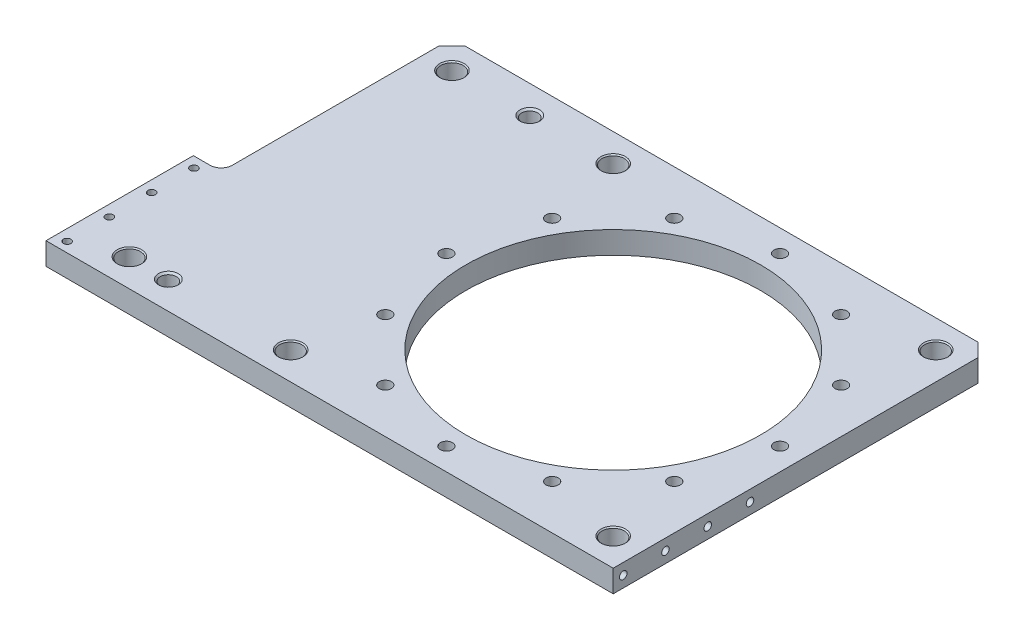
ISO-10303-21;
HEADER;
FILE_DESCRIPTION(('STEP AP214'),'2;1');
FILE_NAME('part.step','',(''),(''),'','','');
FILE_SCHEMA(('AUTOMOTIVE_DESIGN { 1 0 10303 214 1 1 1 1 }'));
ENDSEC;
DATA;
#1=APPLICATION_CONTEXT('core data for automotive mechanical design processes');
#2=APPLICATION_PROTOCOL_DEFINITION('international standard','automotive_design',2000,#1);
#3=PRODUCT_CONTEXT('',#1,'mechanical');
#4=PRODUCT('Part','Part','',(#3));
#5=PRODUCT_RELATED_PRODUCT_CATEGORY('part','',(#4));
#6=PRODUCT_DEFINITION_FORMATION('','',#4);
#7=PRODUCT_DEFINITION_CONTEXT('part definition',#1,'design');
#8=PRODUCT_DEFINITION('design','',#6,#7);
#9=PRODUCT_DEFINITION_SHAPE('','',#8);
#10=(LENGTH_UNIT() NAMED_UNIT(*) SI_UNIT(.MILLI.,.METRE.));
#11=(NAMED_UNIT(*) PLANE_ANGLE_UNIT() SI_UNIT($,.RADIAN.));
#12=(NAMED_UNIT(*) SI_UNIT($,.STERADIAN.) SOLID_ANGLE_UNIT());
#13=UNCERTAINTY_MEASURE_WITH_UNIT(LENGTH_MEASURE(1.E-05),#10,'distance_accuracy_value','');
#14=(GEOMETRIC_REPRESENTATION_CONTEXT(3) GLOBAL_UNCERTAINTY_ASSIGNED_CONTEXT((#13)) GLOBAL_UNIT_ASSIGNED_CONTEXT((#10,
#11,#12)) REPRESENTATION_CONTEXT('',''));
#15=CARTESIAN_POINT('',(0.,0.,0.));
#16=DIRECTION('',(0.,0.,1.));
#17=DIRECTION('',(1.,0.,0.));
#18=AXIS2_PLACEMENT_3D('',#15,#16,#17);
#19=CARTESIAN_POINT('',(-315.,20.,-170.));
#20=DIRECTION('',(1.,0.,0.));
#21=DIRECTION('',(0.,0.,-1.));
#22=AXIS2_PLACEMENT_3D('',#19,#20,#21);
#23=PLANE('',#22);
#24=DIRECTION('',(0.,0.,1.));
#25=VECTOR('',#24,1.);
#26=CARTESIAN_POINT('',(-315.,0.,-170.));
#27=LINE('',#26,#25);
#28=CARTESIAN_POINT('',(-315.,0.,-158.));
#29=VERTEX_POINT('',#28);
#30=CARTESIAN_POINT('',(-315.,0.,27.5));
#31=VERTEX_POINT('',#30);
#32=EDGE_CURVE('E257',#29,#31,#27,.T.);
#33=ORIENTED_EDGE('',*,*,#32,.T.);
#34=DIRECTION('',(0.,-1.,0.));
#35=VECTOR('',#34,1.);
#36=CARTESIAN_POINT('',(-315.,20.,27.5));
#37=LINE('',#36,#35);
#38=CARTESIAN_POINT('',(-315.,20.,27.5));
#39=VERTEX_POINT('',#38);
#40=EDGE_CURVE('E62',#31,#39,#37,.F.);
#41=ORIENTED_EDGE('',*,*,#40,.T.);
#42=DIRECTION('',(0.,0.,1.));
#43=VECTOR('',#42,1.);
#44=CARTESIAN_POINT('',(-315.,20.,-170.));
#45=LINE('',#44,#43);
#46=CARTESIAN_POINT('',(-315.,20.,-158.));
#47=VERTEX_POINT('',#46);
#48=EDGE_CURVE('E137',#47,#39,#45,.T.);
#49=ORIENTED_EDGE('',*,*,#48,.F.);
#50=DIRECTION('',(0.,-1.,0.));
#51=VECTOR('',#50,1.);
#52=CARTESIAN_POINT('',(-315.,20.,-158.));
#53=LINE('',#52,#51);
#54=EDGE_CURVE('E290',#47,#29,#53,.T.);
#55=ORIENTED_EDGE('',*,*,#54,.T.);
#56=EDGE_LOOP('',(#33,#41,#49,#55));
#57=FACE_BOUND('',#56,.T.);
#58=ADVANCED_FACE('F40',(#57),#23,.F.);
#59=CARTESIAN_POINT('',(-315.,20.,170.));
#60=DIRECTION('',(0.,1.,0.));
#61=DIRECTION('',(0.,0.,1.));
#62=AXIS2_PLACEMENT_3D('',#59,#60,#61);
#63=PLANE('',#62);
#64=CARTESIAN_POINT('',(-220.000000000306,20.,-145.));
#65=DIRECTION('',(0.,1.,0.));
#66=DIRECTION('',(0.,0.,1.));
#67=AXIS2_PLACEMENT_3D('',#64,#65,#66);
#68=CIRCLE('',#67,8.85);
#69=CARTESIAN_POINT('',(-220.000000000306,20.,-136.15));
#70=VERTEX_POINT('',#69);
#71=EDGE_CURVE('E558',#70,#70,#68,.T.);
#72=ORIENTED_EDGE('',*,*,#71,.F.);
#73=EDGE_LOOP('',(#72));
#74=FACE_BOUND('',#73,.T.);
#75=CARTESIAN_POINT('',(-255.,20.,145.));
#76=DIRECTION('',(0.,1.,0.));
#77=DIRECTION('',(0.,0.,1.));
#78=AXIS2_PLACEMENT_3D('',#75,#76,#77);
#79=CIRCLE('',#78,8.85);
#80=CARTESIAN_POINT('',(-255.,20.,153.85));
#81=VERTEX_POINT('',#80);
#82=EDGE_CURVE('E549',#81,#81,#79,.T.);
#83=ORIENTED_EDGE('',*,*,#82,.F.);
#84=EDGE_LOOP('',(#83));
#85=FACE_BOUND('',#84,.T.);
#86=CARTESIAN_POINT('',(145.,20.,-145.));
#87=DIRECTION('',(0.,1.,0.));
#88=DIRECTION('',(0.,0.,1.));
#89=AXIS2_PLACEMENT_3D('',#86,#87,#88);
#90=CIRCLE('',#89,11.0000000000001);
#91=CARTESIAN_POINT('',(145.,20.,-134.));
#92=VERTEX_POINT('',#91);
#93=EDGE_CURVE('E339',#92,#92,#90,.F.);
#94=ORIENTED_EDGE('',*,*,#93,.T.);
#95=EDGE_LOOP('',(#94));
#96=FACE_BOUND('',#95,.T.);
#97=CARTESIAN_POINT('',(-145.,20.,-145.));
#98=DIRECTION('',(0.,1.,0.));
#99=DIRECTION('',(0.,0.,1.));
#100=AXIS2_PLACEMENT_3D('',#97,#98,#99);
#101=CIRCLE('',#100,11.0000000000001);
#102=CARTESIAN_POINT('',(-145.,20.,-134.));
#103=VERTEX_POINT('',#102);
#104=EDGE_CURVE('E336',#103,#103,#101,.F.);
#105=ORIENTED_EDGE('',*,*,#104,.T.);
#106=EDGE_LOOP('',(#105));
#107=FACE_BOUND('',#106,.T.);
#108=CARTESIAN_POINT('',(-290.,20.,-145.));
#109=DIRECTION('',(0.,1.,0.));
#110=DIRECTION('',(0.,0.,1.));
#111=AXIS2_PLACEMENT_3D('',#108,#109,#110);
#112=CIRCLE('',#111,11.0000000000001);
#113=CARTESIAN_POINT('',(-290.,20.,-134.));
#114=VERTEX_POINT('',#113);
#115=EDGE_CURVE('E333',#114,#114,#112,.F.);
#116=ORIENTED_EDGE('',*,*,#115,.T.);
#117=EDGE_LOOP('',(#116));
#118=FACE_BOUND('',#117,.T.);
#119=CARTESIAN_POINT('',(-290.,20.,145.));
#120=DIRECTION('',(0.,1.,0.));
#121=DIRECTION('',(0.,0.,1.));
#122=AXIS2_PLACEMENT_3D('',#119,#120,#121);
#123=CIRCLE('',#122,11.0000000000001);
#124=CARTESIAN_POINT('',(-290.,20.,156.));
#125=VERTEX_POINT('',#124);
#126=EDGE_CURVE('E330',#125,#125,#123,.F.);
#127=ORIENTED_EDGE('',*,*,#126,.T.);
#128=EDGE_LOOP('',(#127));
#129=FACE_BOUND('',#128,.T.);
#130=CARTESIAN_POINT('',(-145.,20.,145.));
#131=DIRECTION('',(0.,1.,0.));
#132=DIRECTION('',(0.,0.,1.));
#133=AXIS2_PLACEMENT_3D('',#130,#131,#132);
#134=CIRCLE('',#133,11.0000000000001);
#135=CARTESIAN_POINT('',(-145.,20.,156.));
#136=VERTEX_POINT('',#135);
#137=EDGE_CURVE('E327',#136,#136,#134,.F.);
#138=ORIENTED_EDGE('',*,*,#137,.T.);
#139=EDGE_LOOP('',(#138));
#140=FACE_BOUND('',#139,.T.);
#141=CARTESIAN_POINT('',(145.,20.,145.));
#142=DIRECTION('',(0.,1.,0.));
#143=DIRECTION('',(0.,0.,1.));
#144=AXIS2_PLACEMENT_3D('',#141,#142,#143);
#145=CIRCLE('',#144,11.0000000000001);
#146=CARTESIAN_POINT('',(145.,20.,156.));
#147=VERTEX_POINT('',#146);
#148=EDGE_CURVE('E324',#147,#147,#145,.F.);
#149=ORIENTED_EDGE('',*,*,#148,.T.);
#150=EDGE_LOOP('',(#149));
#151=FACE_BOUND('',#150,.T.);
#152=CARTESIAN_POINT('',(-330.,20.,161.));
#153=DIRECTION('',(0.,1.,0.));
#154=DIRECTION('',(0.,0.,1.));
#155=AXIS2_PLACEMENT_3D('',#152,#153,#154);
#156=CIRCLE('',#155,3.40000000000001);
#157=CARTESIAN_POINT('',(-330.,20.,164.4));
#158=VERTEX_POINT('',#157);
#159=EDGE_CURVE('E540',#158,#158,#156,.T.);
#160=ORIENTED_EDGE('',*,*,#159,.F.);
#161=EDGE_LOOP('',(#160));
#162=FACE_BOUND('',#161,.T.);
#163=CARTESIAN_POINT('',(-330.,20.,123.));
#164=DIRECTION('',(0.,1.,0.));
#165=DIRECTION('',(0.,0.,1.));
#166=AXIS2_PLACEMENT_3D('',#163,#164,#165);
#167=CIRCLE('',#166,3.40000000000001);
#168=CARTESIAN_POINT('',(-330.,20.,126.4));
#169=VERTEX_POINT('',#168);
#170=EDGE_CURVE('E534',#169,#169,#167,.T.);
#171=ORIENTED_EDGE('',*,*,#170,.F.);
#172=EDGE_LOOP('',(#171));
#173=FACE_BOUND('',#172,.T.);
#174=CARTESIAN_POINT('',(-330.,20.,85.));
#175=DIRECTION('',(0.,1.,0.));
#176=DIRECTION('',(0.,0.,1.));
#177=AXIS2_PLACEMENT_3D('',#174,#175,#176);
#178=CIRCLE('',#177,3.40000000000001);
#179=CARTESIAN_POINT('',(-330.,20.,88.4));
#180=VERTEX_POINT('',#179);
#181=EDGE_CURVE('E528',#180,#180,#178,.T.);
#182=ORIENTED_EDGE('',*,*,#181,.F.);
#183=EDGE_LOOP('',(#182));
#184=FACE_BOUND('',#183,.T.);
#185=CARTESIAN_POINT('',(-330.,20.,47.));
#186=DIRECTION('',(0.,1.,0.));
#187=DIRECTION('',(0.,0.,1.));
#188=AXIS2_PLACEMENT_3D('',#185,#186,#187);
#189=CIRCLE('',#188,3.40000000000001);
#190=CARTESIAN_POINT('',(-330.,20.,50.4));
#191=VERTEX_POINT('',#190);
#192=EDGE_CURVE('E522',#191,#191,#189,.T.);
#193=ORIENTED_EDGE('',*,*,#192,.F.);
#194=EDGE_LOOP('',(#193));
#195=FACE_BOUND('',#194,.T.);
#196=CARTESIAN_POINT('',(-129.903810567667,20.,74.9999999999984));
#197=DIRECTION('',(0.,1.,0.));
#198=DIRECTION('',(0.499999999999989,0.,0.866025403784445));
#199=AXIS2_PLACEMENT_3D('',#196,#197,#198);
#200=CIRCLE('',#199,5.50000000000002);
#201=CARTESIAN_POINT('',(-127.153810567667,20.,79.7631397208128));
#202=VERTEX_POINT('',#201);
#203=EDGE_CURVE('E181',#202,#202,#200,.T.);
#204=ORIENTED_EDGE('',*,*,#203,.F.);
#205=EDGE_LOOP('',(#204));
#206=FACE_BOUND('',#205,.T.);
#207=CARTESIAN_POINT('',(-75.0000000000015,20.,129.903810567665));
#208=DIRECTION('',(0.,1.,0.));
#209=DIRECTION('',(0.866025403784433,0.,0.50000000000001));
#210=AXIS2_PLACEMENT_3D('',#207,#208,#209);
#211=CIRCLE('',#210,5.50000000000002);
#212=CARTESIAN_POINT('',(-70.2368602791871,20.,132.653810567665));
#213=VERTEX_POINT('',#212);
#214=EDGE_CURVE('E185',#213,#213,#211,.T.);
#215=ORIENTED_EDGE('',*,*,#214,.F.);
#216=EDGE_LOOP('',(#215));
#217=FACE_BOUND('',#216,.T.);
#218=CARTESIAN_POINT('',(-1.57116660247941E-12,20.,150.));
#219=DIRECTION('',(0.,1.,0.));
#220=DIRECTION('',(1.,0.,0.));
#221=AXIS2_PLACEMENT_3D('',#218,#219,#220);
#222=CIRCLE('',#221,5.50000000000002);
#223=CARTESIAN_POINT('',(5.49999999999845,20.,150.));
#224=VERTEX_POINT('',#223);
#225=EDGE_CURVE('E191',#224,#224,#222,.T.);
#226=ORIENTED_EDGE('',*,*,#225,.F.);
#227=EDGE_LOOP('',(#226));
#228=FACE_BOUND('',#227,.T.);
#229=CARTESIAN_POINT('',(74.9999999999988,20.,129.903810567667));
#230=DIRECTION('',(0.,1.,0.));
#231=DIRECTION('',(0.866025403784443,0.,-0.499999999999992));
#232=AXIS2_PLACEMENT_3D('',#229,#230,#231);
#233=CIRCLE('',#232,5.50000000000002);
#234=CARTESIAN_POINT('',(79.7631397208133,20.,127.153810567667));
#235=VERTEX_POINT('',#234);
#236=EDGE_CURVE('E197',#235,#235,#233,.T.);
#237=ORIENTED_EDGE('',*,*,#236,.F.);
#238=EDGE_LOOP('',(#237));
#239=FACE_BOUND('',#238,.T.);
#240=CARTESIAN_POINT('',(129.903810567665,20.,75.0000000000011));
#241=DIRECTION('',(0.,1.,0.));
#242=DIRECTION('',(0.500000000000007,0.,-0.866025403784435));
#243=AXIS2_PLACEMENT_3D('',#240,#241,#242);
#244=CIRCLE('',#243,5.50000000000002);
#245=CARTESIAN_POINT('',(132.653810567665,20.,70.2368602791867));
#246=VERTEX_POINT('',#245);
#247=EDGE_CURVE('E203',#246,#246,#244,.T.);
#248=ORIENTED_EDGE('',*,*,#247,.F.);
#249=EDGE_LOOP('',(#248));
#250=FACE_BOUND('',#249,.T.);
#251=CARTESIAN_POINT('',(150.,20.,0.));
#252=DIRECTION('',(0.,1.,0.));
#253=DIRECTION('',(0.,0.,-1.));
#254=AXIS2_PLACEMENT_3D('',#251,#252,#253);
#255=CIRCLE('',#254,5.50000000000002);
#256=CARTESIAN_POINT('',(150.,20.,-5.50000000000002));
#257=VERTEX_POINT('',#256);
#258=EDGE_CURVE('E209',#257,#257,#255,.T.);
#259=ORIENTED_EDGE('',*,*,#258,.F.);
#260=EDGE_LOOP('',(#259));
#261=FACE_BOUND('',#260,.T.);
#262=CARTESIAN_POINT('',(129.903810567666,20.,-74.9999999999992));
#263=DIRECTION('',(0.,1.,0.));
#264=DIRECTION('',(-0.499999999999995,0.,-0.866025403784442));
#265=AXIS2_PLACEMENT_3D('',#262,#263,#264);
#266=CIRCLE('',#265,5.50000000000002);
#267=CARTESIAN_POINT('',(127.153810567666,20.,-79.7631397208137));
#268=VERTEX_POINT('',#267);
#269=EDGE_CURVE('E215',#268,#268,#266,.T.);
#270=ORIENTED_EDGE('',*,*,#269,.F.);
#271=EDGE_LOOP('',(#270));
#272=FACE_BOUND('',#271,.T.);
#273=CARTESIAN_POINT('',(75.0000000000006,20.,-129.903810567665));
#274=DIRECTION('',(0.,1.,0.));
#275=DIRECTION('',(-0.866025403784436,0.,-0.500000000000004));
#276=AXIS2_PLACEMENT_3D('',#273,#274,#275);
#277=CIRCLE('',#276,5.50000000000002);
#278=CARTESIAN_POINT('',(70.2368602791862,20.,-132.653810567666));
#279=VERTEX_POINT('',#278);
#280=EDGE_CURVE('E221',#279,#279,#277,.T.);
#281=ORIENTED_EDGE('',*,*,#280,.F.);
#282=EDGE_LOOP('',(#281));
#283=FACE_BOUND('',#282,.T.);
#284=CARTESIAN_POINT('',(5.2372220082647E-13,20.,-150.));
#285=DIRECTION('',(0.,1.,0.));
#286=DIRECTION('',(-1.,0.,0.));
#287=AXIS2_PLACEMENT_3D('',#284,#285,#286);
#288=CIRCLE('',#287,5.50000000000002);
#289=CARTESIAN_POINT('',(-5.49999999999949,20.,-150.));
#290=VERTEX_POINT('',#289);
#291=EDGE_CURVE('E227',#290,#290,#288,.T.);
#292=ORIENTED_EDGE('',*,*,#291,.F.);
#293=EDGE_LOOP('',(#292));
#294=FACE_BOUND('',#293,.T.);
#295=CARTESIAN_POINT('',(-74.9999999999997,20.,-129.903810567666));
#296=DIRECTION('',(0.,1.,0.));
#297=DIRECTION('',(-0.86602540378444,0.,0.499999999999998));
#298=AXIS2_PLACEMENT_3D('',#295,#296,#297);
#299=CIRCLE('',#298,5.50000000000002);
#300=CARTESIAN_POINT('',(-79.7631397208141,20.,-127.153810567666));
#301=VERTEX_POINT('',#300);
#302=EDGE_CURVE('E233',#301,#301,#299,.T.);
#303=ORIENTED_EDGE('',*,*,#302,.F.);
#304=EDGE_LOOP('',(#303));
#305=FACE_BOUND('',#304,.T.);
#306=CARTESIAN_POINT('',(-129.903810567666,20.,-75.0000000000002));
#307=DIRECTION('',(0.,1.,0.));
#308=DIRECTION('',(-0.500000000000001,0.,0.866025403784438));
#309=AXIS2_PLACEMENT_3D('',#306,#307,#308);
#310=CIRCLE('',#309,5.50000000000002);
#311=CARTESIAN_POINT('',(-132.653810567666,20.,-70.2368602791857));
#312=VERTEX_POINT('',#311);
#313=EDGE_CURVE('E239',#312,#312,#310,.T.);
#314=ORIENTED_EDGE('',*,*,#313,.F.);
#315=EDGE_LOOP('',(#314));
#316=FACE_BOUND('',#315,.T.);
#317=CARTESIAN_POINT('',(-150.,20.,0.));
#318=DIRECTION('',(0.,1.,0.));
#319=DIRECTION('',(0.,0.,1.));
#320=AXIS2_PLACEMENT_3D('',#317,#318,#319);
#321=CIRCLE('',#320,5.50000000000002);
#322=CARTESIAN_POINT('',(-150.,20.,5.50000000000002));
#323=VERTEX_POINT('',#322);
#324=EDGE_CURVE('E245',#323,#323,#321,.T.);
#325=ORIENTED_EDGE('',*,*,#324,.F.);
#326=EDGE_LOOP('',(#325));
#327=FACE_BOUND('',#326,.T.);
#328=DIRECTION('',(0.,0.,-1.));
#329=VECTOR('',#328,1.);
#330=CARTESIAN_POINT('',(170.,20.,-170.));
#331=LINE('',#330,#329);
#332=CARTESIAN_POINT('',(170.,20.,170.));
#333=VERTEX_POINT('',#332);
#334=CARTESIAN_POINT('',(170.,20.,-158.));
#335=VERTEX_POINT('',#334);
#336=EDGE_CURVE('E136',#333,#335,#331,.T.);
#337=ORIENTED_EDGE('',*,*,#336,.T.);
#338=DIRECTION('',(0.707106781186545,0.,0.70710678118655));
#339=VECTOR('',#338,1.);
#340=CARTESIAN_POINT('',(91.5000000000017,20.,-236.499999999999));
#341=LINE('',#340,#339);
#342=CARTESIAN_POINT('',(158.,20.,-170.));
#343=VERTEX_POINT('',#342);
#344=EDGE_CURVE('E288',#335,#343,#341,.F.);
#345=ORIENTED_EDGE('',*,*,#344,.T.);
#346=DIRECTION('',(-1.,0.,0.));
#347=VECTOR('',#346,1.);
#348=CARTESIAN_POINT('',(-315.,20.,-170.));
#349=LINE('',#348,#347);
#350=CARTESIAN_POINT('',(-303.,20.,-170.));
#351=VERTEX_POINT('',#350);
#352=EDGE_CURVE('E263',#343,#351,#349,.T.);
#353=ORIENTED_EDGE('',*,*,#352,.T.);
#354=DIRECTION('',(0.707106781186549,0.,-0.707106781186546));
#355=VECTOR('',#354,1.);
#356=CARTESIAN_POINT('',(-479.,20.,5.99999999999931));
#357=LINE('',#356,#355);
#358=EDGE_CURVE('E286',#351,#47,#357,.F.);
#359=ORIENTED_EDGE('',*,*,#358,.T.);
#360=ORIENTED_EDGE('',*,*,#48,.T.);
#361=CARTESIAN_POINT('',(-325.,20.,27.5));
#362=DIRECTION('',(0.,1.,0.));
#363=DIRECTION('',(0.,0.,1.));
#364=AXIS2_PLACEMENT_3D('',#361,#362,#363);
#365=CIRCLE('',#364,10.);
#366=CARTESIAN_POINT('',(-325.,20.,37.5));
#367=VERTEX_POINT('',#366);
#368=EDGE_CURVE('E298',#39,#367,#365,.F.);
#369=ORIENTED_EDGE('',*,*,#368,.T.);
#370=DIRECTION('',(1.,0.,0.));
#371=VECTOR('',#370,1.);
#372=CARTESIAN_POINT('',(-315.,20.,37.5));
#373=LINE('',#372,#371);
#374=CARTESIAN_POINT('',(-340.,20.,37.5));
#375=VERTEX_POINT('',#374);
#376=EDGE_CURVE('E144',#375,#367,#373,.T.);
#377=ORIENTED_EDGE('',*,*,#376,.F.);
#378=DIRECTION('',(0.,0.,-1.));
#379=VECTOR('',#378,1.);
#380=CARTESIAN_POINT('',(-340.,20.,170.));
#381=LINE('',#380,#379);
#382=CARTESIAN_POINT('',(-340.,20.,170.));
#383=VERTEX_POINT('',#382);
#384=EDGE_CURVE('E140',#383,#375,#381,.T.);
#385=ORIENTED_EDGE('',*,*,#384,.F.);
#386=DIRECTION('',(1.,0.,0.));
#387=VECTOR('',#386,1.);
#388=CARTESIAN_POINT('',(-315.,20.,170.));
#389=LINE('',#388,#387);
#390=EDGE_CURVE('E125',#383,#333,#389,.T.);
#391=ORIENTED_EDGE('',*,*,#390,.T.);
#392=EDGE_LOOP('',(#337,#345,#353,#359,#360,#369,#377,#385,#391));
#393=FACE_BOUND('',#392,.T.);
#394=CARTESIAN_POINT('',(0.,20.,0.));
#395=DIRECTION('',(0.,1.,0.));
#396=DIRECTION('',(0.,0.,1.));
#397=AXIS2_PLACEMENT_3D('',#394,#395,#396);
#398=CIRCLE('',#397,132.5);
#399=CARTESIAN_POINT('',(0.,20.,132.5));
#400=VERTEX_POINT('',#399);
#401=EDGE_CURVE('E254',#400,#400,#398,.T.);
#402=ORIENTED_EDGE('',*,*,#401,.F.);
#403=EDGE_LOOP('',(#402));
#404=FACE_BOUND('',#403,.T.);
#405=ADVANCED_FACE('F141',(#74,#85,#96,#107,#118,#129,#140,#151,#162,#173,#184,#195,#206,#217,
#228,#239,#250,#261,#272,#283,#294,#305,#316,#327,#393,#404),#63,.T.);
#406=CARTESIAN_POINT('',(-315.,0.,170.));
#407=DIRECTION('',(0.,1.,0.));
#408=DIRECTION('',(0.,0.,1.));
#409=AXIS2_PLACEMENT_3D('',#406,#407,#408);
#410=PLANE('',#409);
#411=CARTESIAN_POINT('',(-220.000000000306,0.,-145.));
#412=DIRECTION('',(0.,1.,0.));
#413=DIRECTION('',(0.,0.,1.));
#414=AXIS2_PLACEMENT_3D('',#411,#412,#413);
#415=CIRCLE('',#414,7.24999999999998);
#416=CARTESIAN_POINT('',(-220.000000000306,0.,-137.75));
#417=VERTEX_POINT('',#416);
#418=EDGE_CURVE('E552',#417,#417,#415,.T.);
#419=ORIENTED_EDGE('',*,*,#418,.T.);
#420=EDGE_LOOP('',(#419));
#421=FACE_BOUND('',#420,.T.);
#422=CARTESIAN_POINT('',(-255.,0.,145.));
#423=DIRECTION('',(0.,1.,0.));
#424=DIRECTION('',(0.,0.,1.));
#425=AXIS2_PLACEMENT_3D('',#422,#423,#424);
#426=CIRCLE('',#425,7.24999999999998);
#427=CARTESIAN_POINT('',(-255.,0.,152.25));
#428=VERTEX_POINT('',#427);
#429=EDGE_CURVE('E543',#428,#428,#426,.T.);
#430=ORIENTED_EDGE('',*,*,#429,.T.);
#431=EDGE_LOOP('',(#430));
#432=FACE_BOUND('',#431,.T.);
#433=CARTESIAN_POINT('',(145.,0.,-145.));
#434=DIRECTION('',(0.,1.,0.));
#435=DIRECTION('',(0.,0.,1.));
#436=AXIS2_PLACEMENT_3D('',#433,#434,#435);
#437=CIRCLE('',#436,11.0000000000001);
#438=CARTESIAN_POINT('',(145.,0.,-134.));
#439=VERTEX_POINT('',#438);
#440=EDGE_CURVE('E315',#439,#439,#437,.T.);
#441=ORIENTED_EDGE('',*,*,#440,.T.);
#442=EDGE_LOOP('',(#441));
#443=FACE_BOUND('',#442,.T.);
#444=CARTESIAN_POINT('',(-145.,0.,-145.));
#445=DIRECTION('',(0.,1.,0.));
#446=DIRECTION('',(0.,0.,1.));
#447=AXIS2_PLACEMENT_3D('',#444,#445,#446);
#448=CIRCLE('',#447,11.0000000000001);
#449=CARTESIAN_POINT('',(-145.,0.,-134.));
#450=VERTEX_POINT('',#449);
#451=EDGE_CURVE('E312',#450,#450,#448,.T.);
#452=ORIENTED_EDGE('',*,*,#451,.T.);
#453=EDGE_LOOP('',(#452));
#454=FACE_BOUND('',#453,.T.);
#455=CARTESIAN_POINT('',(-290.,0.,-145.));
#456=DIRECTION('',(0.,1.,0.));
#457=DIRECTION('',(0.,0.,1.));
#458=AXIS2_PLACEMENT_3D('',#455,#456,#457);
#459=CIRCLE('',#458,11.0000000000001);
#460=CARTESIAN_POINT('',(-290.,0.,-134.));
#461=VERTEX_POINT('',#460);
#462=EDGE_CURVE('E309',#461,#461,#459,.T.);
#463=ORIENTED_EDGE('',*,*,#462,.T.);
#464=EDGE_LOOP('',(#463));
#465=FACE_BOUND('',#464,.T.);
#466=CARTESIAN_POINT('',(-290.,0.,145.));
#467=DIRECTION('',(0.,1.,0.));
#468=DIRECTION('',(0.,0.,1.));
#469=AXIS2_PLACEMENT_3D('',#466,#467,#468);
#470=CIRCLE('',#469,11.0000000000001);
#471=CARTESIAN_POINT('',(-290.,0.,156.));
#472=VERTEX_POINT('',#471);
#473=EDGE_CURVE('E306',#472,#472,#470,.T.);
#474=ORIENTED_EDGE('',*,*,#473,.T.);
#475=EDGE_LOOP('',(#474));
#476=FACE_BOUND('',#475,.T.);
#477=CARTESIAN_POINT('',(-145.,0.,145.));
#478=DIRECTION('',(0.,1.,0.));
#479=DIRECTION('',(0.,0.,1.));
#480=AXIS2_PLACEMENT_3D('',#477,#478,#479);
#481=CIRCLE('',#480,11.0000000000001);
#482=CARTESIAN_POINT('',(-145.,0.,156.));
#483=VERTEX_POINT('',#482);
#484=EDGE_CURVE('E303',#483,#483,#481,.T.);
#485=ORIENTED_EDGE('',*,*,#484,.T.);
#486=EDGE_LOOP('',(#485));
#487=FACE_BOUND('',#486,.T.);
#488=CARTESIAN_POINT('',(145.,0.,145.));
#489=DIRECTION('',(0.,1.,0.));
#490=DIRECTION('',(0.,0.,1.));
#491=AXIS2_PLACEMENT_3D('',#488,#489,#490);
#492=CIRCLE('',#491,11.0000000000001);
#493=CARTESIAN_POINT('',(145.,0.,156.));
#494=VERTEX_POINT('',#493);
#495=EDGE_CURVE('E300',#494,#494,#492,.T.);
#496=ORIENTED_EDGE('',*,*,#495,.T.);
#497=EDGE_LOOP('',(#496));
#498=FACE_BOUND('',#497,.T.);
#499=CARTESIAN_POINT('',(-330.,0.,161.));
#500=DIRECTION('',(0.,1.,0.));
#501=DIRECTION('',(0.,0.,1.));
#502=AXIS2_PLACEMENT_3D('',#499,#500,#501);
#503=CIRCLE('',#502,3.40000000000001);
#504=CARTESIAN_POINT('',(-330.,0.,164.4));
#505=VERTEX_POINT('',#504);
#506=EDGE_CURVE('E537',#505,#505,#503,.T.);
#507=ORIENTED_EDGE('',*,*,#506,.T.);
#508=EDGE_LOOP('',(#507));
#509=FACE_BOUND('',#508,.T.);
#510=CARTESIAN_POINT('',(-330.,0.,123.));
#511=DIRECTION('',(0.,1.,0.));
#512=DIRECTION('',(0.,0.,1.));
#513=AXIS2_PLACEMENT_3D('',#510,#511,#512);
#514=CIRCLE('',#513,3.40000000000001);
#515=CARTESIAN_POINT('',(-330.,0.,126.4));
#516=VERTEX_POINT('',#515);
#517=EDGE_CURVE('E531',#516,#516,#514,.T.);
#518=ORIENTED_EDGE('',*,*,#517,.T.);
#519=EDGE_LOOP('',(#518));
#520=FACE_BOUND('',#519,.T.);
#521=CARTESIAN_POINT('',(-330.,0.,85.));
#522=DIRECTION('',(0.,1.,0.));
#523=DIRECTION('',(0.,0.,1.));
#524=AXIS2_PLACEMENT_3D('',#521,#522,#523);
#525=CIRCLE('',#524,3.40000000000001);
#526=CARTESIAN_POINT('',(-330.,0.,88.4));
#527=VERTEX_POINT('',#526);
#528=EDGE_CURVE('E525',#527,#527,#525,.T.);
#529=ORIENTED_EDGE('',*,*,#528,.T.);
#530=EDGE_LOOP('',(#529));
#531=FACE_BOUND('',#530,.T.);
#532=CARTESIAN_POINT('',(-330.,0.,47.));
#533=DIRECTION('',(0.,1.,0.));
#534=DIRECTION('',(0.,0.,1.));
#535=AXIS2_PLACEMENT_3D('',#532,#533,#534);
#536=CIRCLE('',#535,3.40000000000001);
#537=CARTESIAN_POINT('',(-330.,0.,50.4));
#538=VERTEX_POINT('',#537);
#539=EDGE_CURVE('E518',#538,#538,#536,.T.);
#540=ORIENTED_EDGE('',*,*,#539,.T.);
#541=EDGE_LOOP('',(#540));
#542=FACE_BOUND('',#541,.T.);
#543=CARTESIAN_POINT('',(-129.903810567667,0.,74.9999999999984));
#544=DIRECTION('',(0.,1.,0.));
#545=DIRECTION('',(0.499999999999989,0.,0.866025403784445));
#546=AXIS2_PLACEMENT_3D('',#543,#544,#545);
#547=CIRCLE('',#546,5.50000000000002);
#548=CARTESIAN_POINT('',(-127.153810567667,0.,79.7631397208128));
#549=VERTEX_POINT('',#548);
#550=EDGE_CURVE('E182',#549,#549,#547,.T.);
#551=ORIENTED_EDGE('',*,*,#550,.T.);
#552=EDGE_LOOP('',(#551));
#553=FACE_BOUND('',#552,.T.);
#554=CARTESIAN_POINT('',(-75.0000000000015,0.,129.903810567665));
#555=DIRECTION('',(0.,1.,0.));
#556=DIRECTION('',(0.866025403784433,0.,0.50000000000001));
#557=AXIS2_PLACEMENT_3D('',#554,#555,#556);
#558=CIRCLE('',#557,5.50000000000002);
#559=CARTESIAN_POINT('',(-70.2368602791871,0.,132.653810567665));
#560=VERTEX_POINT('',#559);
#561=EDGE_CURVE('E188',#560,#560,#558,.T.);
#562=ORIENTED_EDGE('',*,*,#561,.T.);
#563=EDGE_LOOP('',(#562));
#564=FACE_BOUND('',#563,.T.);
#565=CARTESIAN_POINT('',(-1.57116660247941E-12,0.,150.));
#566=DIRECTION('',(0.,1.,0.));
#567=DIRECTION('',(1.,0.,0.));
#568=AXIS2_PLACEMENT_3D('',#565,#566,#567);
#569=CIRCLE('',#568,5.50000000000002);
#570=CARTESIAN_POINT('',(5.49999999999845,0.,150.));
#571=VERTEX_POINT('',#570);
#572=EDGE_CURVE('E194',#571,#571,#569,.T.);
#573=ORIENTED_EDGE('',*,*,#572,.T.);
#574=EDGE_LOOP('',(#573));
#575=FACE_BOUND('',#574,.T.);
#576=CARTESIAN_POINT('',(74.9999999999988,0.,129.903810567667));
#577=DIRECTION('',(0.,1.,0.));
#578=DIRECTION('',(0.866025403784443,0.,-0.499999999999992));
#579=AXIS2_PLACEMENT_3D('',#576,#577,#578);
#580=CIRCLE('',#579,5.50000000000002);
#581=CARTESIAN_POINT('',(79.7631397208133,0.,127.153810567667));
#582=VERTEX_POINT('',#581);
#583=EDGE_CURVE('E200',#582,#582,#580,.T.);
#584=ORIENTED_EDGE('',*,*,#583,.T.);
#585=EDGE_LOOP('',(#584));
#586=FACE_BOUND('',#585,.T.);
#587=CARTESIAN_POINT('',(129.903810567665,0.,75.0000000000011));
#588=DIRECTION('',(0.,1.,0.));
#589=DIRECTION('',(0.500000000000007,0.,-0.866025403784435));
#590=AXIS2_PLACEMENT_3D('',#587,#588,#589);
#591=CIRCLE('',#590,5.50000000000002);
#592=CARTESIAN_POINT('',(132.653810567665,0.,70.2368602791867));
#593=VERTEX_POINT('',#592);
#594=EDGE_CURVE('E206',#593,#593,#591,.T.);
#595=ORIENTED_EDGE('',*,*,#594,.T.);
#596=EDGE_LOOP('',(#595));
#597=FACE_BOUND('',#596,.T.);
#598=CARTESIAN_POINT('',(150.,0.,0.));
#599=DIRECTION('',(0.,1.,0.));
#600=DIRECTION('',(0.,0.,-1.));
#601=AXIS2_PLACEMENT_3D('',#598,#599,#600);
#602=CIRCLE('',#601,5.50000000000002);
#603=CARTESIAN_POINT('',(150.,0.,-5.50000000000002));
#604=VERTEX_POINT('',#603);
#605=EDGE_CURVE('E212',#604,#604,#602,.T.);
#606=ORIENTED_EDGE('',*,*,#605,.T.);
#607=EDGE_LOOP('',(#606));
#608=FACE_BOUND('',#607,.T.);
#609=CARTESIAN_POINT('',(129.903810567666,0.,-74.9999999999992));
#610=DIRECTION('',(0.,1.,0.));
#611=DIRECTION('',(-0.499999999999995,0.,-0.866025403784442));
#612=AXIS2_PLACEMENT_3D('',#609,#610,#611);
#613=CIRCLE('',#612,5.50000000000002);
#614=CARTESIAN_POINT('',(127.153810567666,0.,-79.7631397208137));
#615=VERTEX_POINT('',#614);
#616=EDGE_CURVE('E218',#615,#615,#613,.T.);
#617=ORIENTED_EDGE('',*,*,#616,.T.);
#618=EDGE_LOOP('',(#617));
#619=FACE_BOUND('',#618,.T.);
#620=CARTESIAN_POINT('',(75.0000000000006,0.,-129.903810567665));
#621=DIRECTION('',(0.,1.,0.));
#622=DIRECTION('',(-0.866025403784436,0.,-0.500000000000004));
#623=AXIS2_PLACEMENT_3D('',#620,#621,#622);
#624=CIRCLE('',#623,5.50000000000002);
#625=CARTESIAN_POINT('',(70.2368602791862,0.,-132.653810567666));
#626=VERTEX_POINT('',#625);
#627=EDGE_CURVE('E224',#626,#626,#624,.T.);
#628=ORIENTED_EDGE('',*,*,#627,.T.);
#629=EDGE_LOOP('',(#628));
#630=FACE_BOUND('',#629,.T.);
#631=CARTESIAN_POINT('',(5.2372220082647E-13,0.,-150.));
#632=DIRECTION('',(0.,1.,0.));
#633=DIRECTION('',(-1.,0.,0.));
#634=AXIS2_PLACEMENT_3D('',#631,#632,#633);
#635=CIRCLE('',#634,5.50000000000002);
#636=CARTESIAN_POINT('',(-5.49999999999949,0.,-150.));
#637=VERTEX_POINT('',#636);
#638=EDGE_CURVE('E230',#637,#637,#635,.T.);
#639=ORIENTED_EDGE('',*,*,#638,.T.);
#640=EDGE_LOOP('',(#639));
#641=FACE_BOUND('',#640,.T.);
#642=CARTESIAN_POINT('',(-74.9999999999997,0.,-129.903810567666));
#643=DIRECTION('',(0.,1.,0.));
#644=DIRECTION('',(-0.86602540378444,0.,0.499999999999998));
#645=AXIS2_PLACEMENT_3D('',#642,#643,#644);
#646=CIRCLE('',#645,5.50000000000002);
#647=CARTESIAN_POINT('',(-79.7631397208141,0.,-127.153810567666));
#648=VERTEX_POINT('',#647);
#649=EDGE_CURVE('E236',#648,#648,#646,.T.);
#650=ORIENTED_EDGE('',*,*,#649,.T.);
#651=EDGE_LOOP('',(#650));
#652=FACE_BOUND('',#651,.T.);
#653=CARTESIAN_POINT('',(-129.903810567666,0.,-75.0000000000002));
#654=DIRECTION('',(0.,1.,0.));
#655=DIRECTION('',(-0.500000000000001,0.,0.866025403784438));
#656=AXIS2_PLACEMENT_3D('',#653,#654,#655);
#657=CIRCLE('',#656,5.50000000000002);
#658=CARTESIAN_POINT('',(-132.653810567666,0.,-70.2368602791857));
#659=VERTEX_POINT('',#658);
#660=EDGE_CURVE('E242',#659,#659,#657,.T.);
#661=ORIENTED_EDGE('',*,*,#660,.T.);
#662=EDGE_LOOP('',(#661));
#663=FACE_BOUND('',#662,.T.);
#664=CARTESIAN_POINT('',(-150.,0.,0.));
#665=DIRECTION('',(0.,1.,0.));
#666=DIRECTION('',(0.,0.,1.));
#667=AXIS2_PLACEMENT_3D('',#664,#665,#666);
#668=CIRCLE('',#667,5.50000000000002);
#669=CARTESIAN_POINT('',(-150.,0.,5.50000000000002));
#670=VERTEX_POINT('',#669);
#671=EDGE_CURVE('E248',#670,#670,#668,.T.);
#672=ORIENTED_EDGE('',*,*,#671,.T.);
#673=EDGE_LOOP('',(#672));
#674=FACE_BOUND('',#673,.T.);
#675=DIRECTION('',(-1.,0.,0.));
#676=VECTOR('',#675,1.);
#677=CARTESIAN_POINT('',(-315.,0.,-170.));
#678=LINE('',#677,#676);
#679=CARTESIAN_POINT('',(158.,0.,-170.));
#680=VERTEX_POINT('',#679);
#681=CARTESIAN_POINT('',(-303.,0.,-170.));
#682=VERTEX_POINT('',#681);
#683=EDGE_CURVE('E260',#680,#682,#678,.T.);
#684=ORIENTED_EDGE('',*,*,#683,.F.);
#685=DIRECTION('',(-0.707106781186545,0.,-0.70710678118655));
#686=VECTOR('',#685,1.);
#687=CARTESIAN_POINT('',(158.,0.,-170.));
#688=LINE('',#687,#686);
#689=CARTESIAN_POINT('',(170.,0.,-158.));
#690=VERTEX_POINT('',#689);
#691=EDGE_CURVE('E282',#680,#690,#688,.F.);
#692=ORIENTED_EDGE('',*,*,#691,.T.);
#693=DIRECTION('',(0.,0.,-1.));
#694=VECTOR('',#693,1.);
#695=CARTESIAN_POINT('',(170.,0.,-170.));
#696=LINE('',#695,#694);
#697=CARTESIAN_POINT('',(170.,0.,170.));
#698=VERTEX_POINT('',#697);
#699=EDGE_CURVE('E269',#698,#690,#696,.T.);
#700=ORIENTED_EDGE('',*,*,#699,.F.);
#701=DIRECTION('',(1.,0.,0.));
#702=VECTOR('',#701,1.);
#703=CARTESIAN_POINT('',(-315.,0.,170.));
#704=LINE('',#703,#702);
#705=CARTESIAN_POINT('',(-340.,0.,170.));
#706=VERTEX_POINT('',#705);
#707=EDGE_CURVE('E267',#706,#698,#704,.T.);
#708=ORIENTED_EDGE('',*,*,#707,.F.);
#709=DIRECTION('',(0.,0.,-1.));
#710=VECTOR('',#709,1.);
#711=CARTESIAN_POINT('',(-340.,0.,170.));
#712=LINE('',#711,#710);
#713=CARTESIAN_POINT('',(-340.,0.,37.5));
#714=VERTEX_POINT('',#713);
#715=EDGE_CURVE('E151',#706,#714,#712,.T.);
#716=ORIENTED_EDGE('',*,*,#715,.T.);
#717=DIRECTION('',(1.,0.,0.));
#718=VECTOR('',#717,1.);
#719=CARTESIAN_POINT('',(-315.,0.,37.5));
#720=LINE('',#719,#718);
#721=CARTESIAN_POINT('',(-325.,0.,37.5));
#722=VERTEX_POINT('',#721);
#723=EDGE_CURVE('E152',#714,#722,#720,.T.);
#724=ORIENTED_EDGE('',*,*,#723,.T.);
#725=CARTESIAN_POINT('',(-325.,0.,27.5));
#726=DIRECTION('',(0.,1.,0.));
#727=DIRECTION('',(0.,0.,1.));
#728=AXIS2_PLACEMENT_3D('',#725,#726,#727);
#729=CIRCLE('',#728,10.);
#730=EDGE_CURVE('E55',#722,#31,#729,.T.);
#731=ORIENTED_EDGE('',*,*,#730,.T.);
#732=ORIENTED_EDGE('',*,*,#32,.F.);
#733=DIRECTION('',(-0.707106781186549,0.,0.707106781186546));
#734=VECTOR('',#733,1.);
#735=CARTESIAN_POINT('',(-315.,0.,-158.));
#736=LINE('',#735,#734);
#737=EDGE_CURVE('E280',#29,#682,#736,.F.);
#738=ORIENTED_EDGE('',*,*,#737,.T.);
#739=EDGE_LOOP('',(#684,#692,#700,#708,#716,#724,#731,#732,#738));
#740=FACE_BOUND('',#739,.T.);
#741=CARTESIAN_POINT('',(0.,0.,0.));
#742=DIRECTION('',(0.,1.,0.));
#743=DIRECTION('',(0.,0.,1.));
#744=AXIS2_PLACEMENT_3D('',#741,#742,#743);
#745=CIRCLE('',#744,132.5);
#746=CARTESIAN_POINT('',(0.,0.,132.5));
#747=VERTEX_POINT('',#746);
#748=EDGE_CURVE('E251',#747,#747,#745,.T.);
#749=ORIENTED_EDGE('',*,*,#748,.T.);
#750=EDGE_LOOP('',(#749));
#751=FACE_BOUND('',#750,.T.);
#752=ADVANCED_FACE('F389',(#421,#432,#443,#454,#465,#476,#487,#498,#509,#520,#531,#542,#553,
#564,#575,#586,#597,#608,#619,#630,#641,#652,#663,#674,#740,#751),#410,.F.);
#753=CARTESIAN_POINT('',(-315.,20.,170.));
#754=DIRECTION('',(0.,0.,-1.));
#755=DIRECTION('',(-1.,0.,0.));
#756=AXIS2_PLACEMENT_3D('',#753,#754,#755);
#757=PLANE('',#756);
#758=ORIENTED_EDGE('',*,*,#707,.T.);
#759=DIRECTION('',(0.,-1.,0.));
#760=VECTOR('',#759,1.);
#761=CARTESIAN_POINT('',(170.,20.,170.));
#762=LINE('',#761,#760);
#763=EDGE_CURVE('E132',#333,#698,#762,.T.);
#764=ORIENTED_EDGE('',*,*,#763,.F.);
#765=ORIENTED_EDGE('',*,*,#390,.F.);
#766=DIRECTION('',(0.,-1.,0.));
#767=VECTOR('',#766,1.);
#768=CARTESIAN_POINT('',(-340.,154.837865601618,170.));
#769=LINE('',#768,#767);
#770=EDGE_CURVE('E129',#383,#706,#769,.T.);
#771=ORIENTED_EDGE('',*,*,#770,.T.);
#772=EDGE_LOOP('',(#758,#764,#765,#771));
#773=FACE_BOUND('',#772,.T.);
#774=ADVANCED_FACE('F127',(#773),#757,.F.);
#775=CARTESIAN_POINT('',(170.,20.,-170.));
#776=DIRECTION('',(-1.,0.,0.));
#777=DIRECTION('',(0.,0.,1.));
#778=AXIS2_PLACEMENT_3D('',#775,#776,#777);
#779=PLANE('',#778);
#780=CARTESIAN_POINT('',(170.,10.,161.));
#781=DIRECTION('',(1.,0.,0.));
#782=DIRECTION('',(0.,0.,-1.));
#783=AXIS2_PLACEMENT_3D('',#780,#781,#782);
#784=CIRCLE('',#783,3.39999999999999);
#785=CARTESIAN_POINT('',(170.,10.,157.6));
#786=VERTEX_POINT('',#785);
#787=EDGE_CURVE('E157',#786,#786,#784,.T.);
#788=ORIENTED_EDGE('',*,*,#787,.F.);
#789=EDGE_LOOP('',(#788));
#790=FACE_BOUND('',#789,.T.);
#791=CARTESIAN_POINT('',(170.,10.,47.));
#792=DIRECTION('',(1.,0.,0.));
#793=DIRECTION('',(0.,0.,-1.));
#794=AXIS2_PLACEMENT_3D('',#791,#792,#793);
#795=CIRCLE('',#794,3.39999999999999);
#796=CARTESIAN_POINT('',(170.,10.,43.6));
#797=VERTEX_POINT('',#796);
#798=EDGE_CURVE('E163',#797,#797,#795,.T.);
#799=ORIENTED_EDGE('',*,*,#798,.F.);
#800=EDGE_LOOP('',(#799));
#801=FACE_BOUND('',#800,.T.);
#802=CARTESIAN_POINT('',(170.,10.,85.));
#803=DIRECTION('',(1.,0.,0.));
#804=DIRECTION('',(0.,0.,-1.));
#805=AXIS2_PLACEMENT_3D('',#802,#803,#804);
#806=CIRCLE('',#805,3.39999999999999);
#807=CARTESIAN_POINT('',(170.,10.,81.6));
#808=VERTEX_POINT('',#807);
#809=EDGE_CURVE('E169',#808,#808,#806,.T.);
#810=ORIENTED_EDGE('',*,*,#809,.F.);
#811=EDGE_LOOP('',(#810));
#812=FACE_BOUND('',#811,.T.);
#813=CARTESIAN_POINT('',(170.,10.,123.));
#814=DIRECTION('',(1.,0.,0.));
#815=DIRECTION('',(0.,0.,-1.));
#816=AXIS2_PLACEMENT_3D('',#813,#814,#815);
#817=CIRCLE('',#816,3.39999999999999);
#818=CARTESIAN_POINT('',(170.,10.,119.6));
#819=VERTEX_POINT('',#818);
#820=EDGE_CURVE('E175',#819,#819,#817,.T.);
#821=ORIENTED_EDGE('',*,*,#820,.F.);
#822=EDGE_LOOP('',(#821));
#823=FACE_BOUND('',#822,.T.);
#824=ORIENTED_EDGE('',*,*,#699,.T.);
#825=DIRECTION('',(0.,1.,0.));
#826=VECTOR('',#825,1.);
#827=CARTESIAN_POINT('',(170.,20.,-158.));
#828=LINE('',#827,#826);
#829=EDGE_CURVE('E284',#690,#335,#828,.T.);
#830=ORIENTED_EDGE('',*,*,#829,.T.);
#831=ORIENTED_EDGE('',*,*,#336,.F.);
#832=ORIENTED_EDGE('',*,*,#763,.T.);
#833=EDGE_LOOP('',(#824,#830,#831,#832));
#834=FACE_BOUND('',#833,.T.);
#835=ADVANCED_FACE('F485',(#790,#801,#812,#823,#834),#779,.F.);
#836=CARTESIAN_POINT('',(-315.,20.,-170.));
#837=DIRECTION('',(0.,0.,1.));
#838=DIRECTION('',(1.,0.,0.));
#839=AXIS2_PLACEMENT_3D('',#836,#837,#838);
#840=PLANE('',#839);
#841=ORIENTED_EDGE('',*,*,#352,.F.);
#842=DIRECTION('',(0.,-1.,0.));
#843=VECTOR('',#842,1.);
#844=CARTESIAN_POINT('',(158.,20.,-170.));
#845=LINE('',#844,#843);
#846=EDGE_CURVE('E277',#343,#680,#845,.T.);
#847=ORIENTED_EDGE('',*,*,#846,.T.);
#848=ORIENTED_EDGE('',*,*,#683,.T.);
#849=DIRECTION('',(0.,1.,0.));
#850=VECTOR('',#849,1.);
#851=CARTESIAN_POINT('',(-303.,20.,-170.));
#852=LINE('',#851,#850);
#853=EDGE_CURVE('E275',#682,#351,#852,.T.);
#854=ORIENTED_EDGE('',*,*,#853,.T.);
#855=EDGE_LOOP('',(#841,#847,#848,#854));
#856=FACE_BOUND('',#855,.T.);
#857=ADVANCED_FACE('F478',(#856),#840,.F.);
#858=CARTESIAN_POINT('',(0.,20.,0.));
#859=DIRECTION('',(0.,-1.,0.));
#860=DIRECTION('',(0.,0.,-1.));
#861=AXIS2_PLACEMENT_3D('',#858,#859,#860);
#862=CYLINDRICAL_SURFACE('',#861,132.5);
#863=ORIENTED_EDGE('',*,*,#401,.T.);
#864=EDGE_LOOP('',(#863));
#865=FACE_BOUND('',#864,.T.);
#866=ORIENTED_EDGE('',*,*,#748,.F.);
#867=EDGE_LOOP('',(#866));
#868=FACE_BOUND('',#867,.T.);
#869=ADVANCED_FACE('F475',(#865,#868),#862,.F.);
#870=CARTESIAN_POINT('',(-290.,20.,145.));
#871=DIRECTION('',(0.,1.,0.));
#872=DIRECTION('',(0.,0.,1.));
#873=AXIS2_PLACEMENT_3D('',#870,#871,#872);
#874=CYLINDRICAL_SURFACE('',#873,10.);
#875=CARTESIAN_POINT('',(-290.,1.00000000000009,145.));
#876=DIRECTION('',(0.,1.,0.));
#877=DIRECTION('',(0.,0.,1.));
#878=AXIS2_PLACEMENT_3D('',#875,#876,#877);
#879=CIRCLE('',#878,10.);
#880=CARTESIAN_POINT('',(-290.,1.00000000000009,155.));
#881=VERTEX_POINT('',#880);
#882=EDGE_CURVE('E357',#881,#881,#879,.F.);
#883=ORIENTED_EDGE('',*,*,#882,.T.);
#884=EDGE_LOOP('',(#883));
#885=FACE_BOUND('',#884,.T.);
#886=CARTESIAN_POINT('',(-290.,18.9999999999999,145.));
#887=DIRECTION('',(0.,1.,0.));
#888=DIRECTION('',(0.,0.,1.));
#889=AXIS2_PLACEMENT_3D('',#886,#887,#888);
#890=CIRCLE('',#889,10.);
#891=CARTESIAN_POINT('',(-290.,18.9999999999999,155.));
#892=VERTEX_POINT('',#891);
#893=EDGE_CURVE('E354',#892,#892,#890,.T.);
#894=ORIENTED_EDGE('',*,*,#893,.T.);
#895=EDGE_LOOP('',(#894));
#896=FACE_BOUND('',#895,.T.);
#897=ADVANCED_FACE('F468',(#885,#896),#874,.F.);
#898=CARTESIAN_POINT('',(-290.,20.,-145.));
#899=DIRECTION('',(0.,1.,0.));
#900=DIRECTION('',(0.,0.,1.));
#901=AXIS2_PLACEMENT_3D('',#898,#899,#900);
#902=CYLINDRICAL_SURFACE('',#901,10.);
#903=CARTESIAN_POINT('',(-290.,1.00000000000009,-145.));
#904=DIRECTION('',(0.,1.,0.));
#905=DIRECTION('',(0.,0.,1.));
#906=AXIS2_PLACEMENT_3D('',#903,#904,#905);
#907=CIRCLE('',#906,10.);
#908=CARTESIAN_POINT('',(-290.,1.00000000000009,-135.));
#909=VERTEX_POINT('',#908);
#910=EDGE_CURVE('E351',#909,#909,#907,.F.);
#911=ORIENTED_EDGE('',*,*,#910,.T.);
#912=EDGE_LOOP('',(#911));
#913=FACE_BOUND('',#912,.T.);
#914=CARTESIAN_POINT('',(-290.,18.9999999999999,-145.));
#915=DIRECTION('',(0.,1.,0.));
#916=DIRECTION('',(0.,0.,1.));
#917=AXIS2_PLACEMENT_3D('',#914,#915,#916);
#918=CIRCLE('',#917,10.);
#919=CARTESIAN_POINT('',(-290.,18.9999999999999,-135.));
#920=VERTEX_POINT('',#919);
#921=EDGE_CURVE('E348',#920,#920,#918,.T.);
#922=ORIENTED_EDGE('',*,*,#921,.T.);
#923=EDGE_LOOP('',(#922));
#924=FACE_BOUND('',#923,.T.);
#925=ADVANCED_FACE('F458',(#913,#924),#902,.F.);
#926=CARTESIAN_POINT('',(-145.,20.,145.));
#927=DIRECTION('',(0.,1.,0.));
#928=DIRECTION('',(0.,0.,1.));
#929=AXIS2_PLACEMENT_3D('',#926,#927,#928);
#930=CYLINDRICAL_SURFACE('',#929,10.);
#931=CARTESIAN_POINT('',(-145.,1.00000000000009,145.));
#932=DIRECTION('',(0.,1.,0.));
#933=DIRECTION('',(0.,0.,1.));
#934=AXIS2_PLACEMENT_3D('',#931,#932,#933);
#935=CIRCLE('',#934,10.);
#936=CARTESIAN_POINT('',(-145.,1.00000000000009,155.));
#937=VERTEX_POINT('',#936);
#938=EDGE_CURVE('E363',#937,#937,#935,.F.);
#939=ORIENTED_EDGE('',*,*,#938,.T.);
#940=EDGE_LOOP('',(#939));
#941=FACE_BOUND('',#940,.T.);
#942=CARTESIAN_POINT('',(-145.,18.9999999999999,145.));
#943=DIRECTION('',(0.,1.,0.));
#944=DIRECTION('',(0.,0.,1.));
#945=AXIS2_PLACEMENT_3D('',#942,#943,#944);
#946=CIRCLE('',#945,10.);
#947=CARTESIAN_POINT('',(-145.,18.9999999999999,155.));
#948=VERTEX_POINT('',#947);
#949=EDGE_CURVE('E360',#948,#948,#946,.T.);
#950=ORIENTED_EDGE('',*,*,#949,.T.);
#951=EDGE_LOOP('',(#950));
#952=FACE_BOUND('',#951,.T.);
#953=ADVANCED_FACE('F456',(#941,#952),#930,.F.);
#954=CARTESIAN_POINT('',(145.,20.,145.));
#955=DIRECTION('',(0.,1.,0.));
#956=DIRECTION('',(0.,0.,1.));
#957=AXIS2_PLACEMENT_3D('',#954,#955,#956);
#958=CYLINDRICAL_SURFACE('',#957,10.);
#959=CARTESIAN_POINT('',(145.,1.00000000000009,145.));
#960=DIRECTION('',(0.,1.,0.));
#961=DIRECTION('',(0.,0.,1.));
#962=AXIS2_PLACEMENT_3D('',#959,#960,#961);
#963=CIRCLE('',#962,10.);
#964=CARTESIAN_POINT('',(145.,1.00000000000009,155.));
#965=VERTEX_POINT('',#964);
#966=EDGE_CURVE('E11',#965,#965,#963,.F.);
#967=ORIENTED_EDGE('',*,*,#966,.T.);
#968=EDGE_LOOP('',(#967));
#969=FACE_BOUND('',#968,.T.);
#970=CARTESIAN_POINT('',(145.,18.9999999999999,145.));
#971=DIRECTION('',(0.,1.,0.));
#972=DIRECTION('',(0.,0.,1.));
#973=AXIS2_PLACEMENT_3D('',#970,#971,#972);
#974=CIRCLE('',#973,10.);
#975=CARTESIAN_POINT('',(145.,18.9999999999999,155.));
#976=VERTEX_POINT('',#975);
#977=EDGE_CURVE('E48',#976,#976,#974,.T.);
#978=ORIENTED_EDGE('',*,*,#977,.T.);
#979=EDGE_LOOP('',(#978));
#980=FACE_BOUND('',#979,.T.);
#981=ADVANCED_FACE('F368',(#969,#980),#958,.F.);
#982=CARTESIAN_POINT('',(145.,20.,-145.));
#983=DIRECTION('',(0.,1.,0.));
#984=DIRECTION('',(0.,0.,1.));
#985=AXIS2_PLACEMENT_3D('',#982,#983,#984);
#986=CYLINDRICAL_SURFACE('',#985,10.);
#987=CARTESIAN_POINT('',(145.,1.00000000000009,-145.));
#988=DIRECTION('',(0.,1.,0.));
#989=DIRECTION('',(0.,0.,1.));
#990=AXIS2_PLACEMENT_3D('',#987,#988,#989);
#991=CIRCLE('',#990,10.);
#992=CARTESIAN_POINT('',(145.,1.00000000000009,-135.));
#993=VERTEX_POINT('',#992);
#994=EDGE_CURVE('E321',#993,#993,#991,.F.);
#995=ORIENTED_EDGE('',*,*,#994,.T.);
#996=EDGE_LOOP('',(#995));
#997=FACE_BOUND('',#996,.T.);
#998=CARTESIAN_POINT('',(145.,18.9999999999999,-145.));
#999=DIRECTION('',(0.,1.,0.));
#1000=DIRECTION('',(0.,0.,1.));
#1001=AXIS2_PLACEMENT_3D('',#998,#999,#1000);
#1002=CIRCLE('',#1001,10.);
#1003=CARTESIAN_POINT('',(145.,18.9999999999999,-135.));
#1004=VERTEX_POINT('',#1003);
#1005=EDGE_CURVE('E318',#1004,#1004,#1002,.T.);
#1006=ORIENTED_EDGE('',*,*,#1005,.T.);
#1007=EDGE_LOOP('',(#1006));
#1008=FACE_BOUND('',#1007,.T.);
#1009=ADVANCED_FACE('F465',(#997,#1008),#986,.F.);
#1010=CARTESIAN_POINT('',(-145.,20.,-145.));
#1011=DIRECTION('',(0.,1.,0.));
#1012=DIRECTION('',(0.,0.,1.));
#1013=AXIS2_PLACEMENT_3D('',#1010,#1011,#1012);
#1014=CYLINDRICAL_SURFACE('',#1013,10.);
#1015=CARTESIAN_POINT('',(-145.,1.00000000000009,-145.));
#1016=DIRECTION('',(0.,1.,0.));
#1017=DIRECTION('',(0.,0.,1.));
#1018=AXIS2_PLACEMENT_3D('',#1015,#1016,#1017);
#1019=CIRCLE('',#1018,10.);
#1020=CARTESIAN_POINT('',(-145.,1.00000000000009,-135.));
#1021=VERTEX_POINT('',#1020);
#1022=EDGE_CURVE('E345',#1021,#1021,#1019,.F.);
#1023=ORIENTED_EDGE('',*,*,#1022,.T.);
#1024=EDGE_LOOP('',(#1023));
#1025=FACE_BOUND('',#1024,.T.);
#1026=CARTESIAN_POINT('',(-145.,18.9999999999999,-145.));
#1027=DIRECTION('',(0.,1.,0.));
#1028=DIRECTION('',(0.,0.,1.));
#1029=AXIS2_PLACEMENT_3D('',#1026,#1027,#1028);
#1030=CIRCLE('',#1029,10.);
#1031=CARTESIAN_POINT('',(-145.,18.9999999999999,-135.));
#1032=VERTEX_POINT('',#1031);
#1033=EDGE_CURVE('E342',#1032,#1032,#1030,.T.);
#1034=ORIENTED_EDGE('',*,*,#1033,.T.);
#1035=EDGE_LOOP('',(#1034));
#1036=FACE_BOUND('',#1035,.T.);
#1037=ADVANCED_FACE('F611',(#1025,#1036),#1014,.F.);
#1038=CARTESIAN_POINT('',(-150.,0.,0.));
#1039=DIRECTION('',(0.,1.,0.));
#1040=DIRECTION('',(0.,0.,1.));
#1041=AXIS2_PLACEMENT_3D('',#1038,#1039,#1040);
#1042=CYLINDRICAL_SURFACE('',#1041,5.50000000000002);
#1043=ORIENTED_EDGE('',*,*,#671,.F.);
#1044=EDGE_LOOP('',(#1043));
#1045=FACE_BOUND('',#1044,.T.);
#1046=ORIENTED_EDGE('',*,*,#324,.T.);
#1047=EDGE_LOOP('',(#1046));
#1048=FACE_BOUND('',#1047,.T.);
#1049=ADVANCED_FACE('F608',(#1045,#1048),#1042,.F.);
#1050=CARTESIAN_POINT('',(-129.903810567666,0.,-75.0000000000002));
#1051=DIRECTION('',(0.,1.,0.));
#1052=DIRECTION('',(0.,0.,1.));
#1053=AXIS2_PLACEMENT_3D('',#1050,#1051,#1052);
#1054=CYLINDRICAL_SURFACE('',#1053,5.50000000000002);
#1055=ORIENTED_EDGE('',*,*,#660,.F.);
#1056=EDGE_LOOP('',(#1055));
#1057=FACE_BOUND('',#1056,.T.);
#1058=ORIENTED_EDGE('',*,*,#313,.T.);
#1059=EDGE_LOOP('',(#1058));
#1060=FACE_BOUND('',#1059,.T.);
#1061=ADVANCED_FACE('F610',(#1057,#1060),#1054,.F.);
#1062=CARTESIAN_POINT('',(-74.9999999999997,0.,-129.903810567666));
#1063=DIRECTION('',(0.,1.,0.));
#1064=DIRECTION('',(0.,0.,1.));
#1065=AXIS2_PLACEMENT_3D('',#1062,#1063,#1064);
#1066=CYLINDRICAL_SURFACE('',#1065,5.50000000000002);
#1067=ORIENTED_EDGE('',*,*,#649,.F.);
#1068=EDGE_LOOP('',(#1067));
#1069=FACE_BOUND('',#1068,.T.);
#1070=ORIENTED_EDGE('',*,*,#302,.T.);
#1071=EDGE_LOOP('',(#1070));
#1072=FACE_BOUND('',#1071,.T.);
#1073=ADVANCED_FACE('F618',(#1069,#1072),#1066,.F.);
#1074=CARTESIAN_POINT('',(5.2372220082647E-13,0.,-150.));
#1075=DIRECTION('',(0.,1.,0.));
#1076=DIRECTION('',(0.,0.,1.));
#1077=AXIS2_PLACEMENT_3D('',#1074,#1075,#1076);
#1078=CYLINDRICAL_SURFACE('',#1077,5.50000000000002);
#1079=ORIENTED_EDGE('',*,*,#638,.F.);
#1080=EDGE_LOOP('',(#1079));
#1081=FACE_BOUND('',#1080,.T.);
#1082=ORIENTED_EDGE('',*,*,#291,.T.);
#1083=EDGE_LOOP('',(#1082));
#1084=FACE_BOUND('',#1083,.T.);
#1085=ADVANCED_FACE('F681',(#1081,#1084),#1078,.F.);
#1086=CARTESIAN_POINT('',(75.0000000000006,0.,-129.903810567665));
#1087=DIRECTION('',(0.,1.,0.));
#1088=DIRECTION('',(0.,0.,1.));
#1089=AXIS2_PLACEMENT_3D('',#1086,#1087,#1088);
#1090=CYLINDRICAL_SURFACE('',#1089,5.50000000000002);
#1091=ORIENTED_EDGE('',*,*,#627,.F.);
#1092=EDGE_LOOP('',(#1091));
#1093=FACE_BOUND('',#1092,.T.);
#1094=ORIENTED_EDGE('',*,*,#280,.T.);
#1095=EDGE_LOOP('',(#1094));
#1096=FACE_BOUND('',#1095,.T.);
#1097=ADVANCED_FACE('F685',(#1093,#1096),#1090,.F.);
#1098=CARTESIAN_POINT('',(129.903810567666,0.,-74.9999999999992));
#1099=DIRECTION('',(0.,1.,0.));
#1100=DIRECTION('',(0.,0.,1.));
#1101=AXIS2_PLACEMENT_3D('',#1098,#1099,#1100);
#1102=CYLINDRICAL_SURFACE('',#1101,5.50000000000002);
#1103=ORIENTED_EDGE('',*,*,#616,.F.);
#1104=EDGE_LOOP('',(#1103));
#1105=FACE_BOUND('',#1104,.T.);
#1106=ORIENTED_EDGE('',*,*,#269,.T.);
#1107=EDGE_LOOP('',(#1106));
#1108=FACE_BOUND('',#1107,.T.);
#1109=ADVANCED_FACE('F691',(#1105,#1108),#1102,.F.);
#1110=CARTESIAN_POINT('',(150.,0.,0.));
#1111=DIRECTION('',(0.,1.,0.));
#1112=DIRECTION('',(0.,0.,1.));
#1113=AXIS2_PLACEMENT_3D('',#1110,#1111,#1112);
#1114=CYLINDRICAL_SURFACE('',#1113,5.50000000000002);
#1115=ORIENTED_EDGE('',*,*,#605,.F.);
#1116=EDGE_LOOP('',(#1115));
#1117=FACE_BOUND('',#1116,.T.);
#1118=ORIENTED_EDGE('',*,*,#258,.T.);
#1119=EDGE_LOOP('',(#1118));
#1120=FACE_BOUND('',#1119,.T.);
#1121=ADVANCED_FACE('F695',(#1117,#1120),#1114,.F.);
#1122=CARTESIAN_POINT('',(129.903810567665,0.,75.0000000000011));
#1123=DIRECTION('',(0.,1.,0.));
#1124=DIRECTION('',(0.,0.,1.));
#1125=AXIS2_PLACEMENT_3D('',#1122,#1123,#1124);
#1126=CYLINDRICAL_SURFACE('',#1125,5.50000000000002);
#1127=ORIENTED_EDGE('',*,*,#594,.F.);
#1128=EDGE_LOOP('',(#1127));
#1129=FACE_BOUND('',#1128,.T.);
#1130=ORIENTED_EDGE('',*,*,#247,.T.);
#1131=EDGE_LOOP('',(#1130));
#1132=FACE_BOUND('',#1131,.T.);
#1133=ADVANCED_FACE('F699',(#1129,#1132),#1126,.F.);
#1134=CARTESIAN_POINT('',(74.9999999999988,0.,129.903810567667));
#1135=DIRECTION('',(0.,1.,0.));
#1136=DIRECTION('',(0.,0.,1.));
#1137=AXIS2_PLACEMENT_3D('',#1134,#1135,#1136);
#1138=CYLINDRICAL_SURFACE('',#1137,5.50000000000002);
#1139=ORIENTED_EDGE('',*,*,#583,.F.);
#1140=EDGE_LOOP('',(#1139));
#1141=FACE_BOUND('',#1140,.T.);
#1142=ORIENTED_EDGE('',*,*,#236,.T.);
#1143=EDGE_LOOP('',(#1142));
#1144=FACE_BOUND('',#1143,.T.);
#1145=ADVANCED_FACE('F703',(#1141,#1144),#1138,.F.);
#1146=CARTESIAN_POINT('',(-1.57116660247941E-12,0.,150.));
#1147=DIRECTION('',(0.,1.,0.));
#1148=DIRECTION('',(0.,0.,1.));
#1149=AXIS2_PLACEMENT_3D('',#1146,#1147,#1148);
#1150=CYLINDRICAL_SURFACE('',#1149,5.50000000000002);
#1151=ORIENTED_EDGE('',*,*,#572,.F.);
#1152=EDGE_LOOP('',(#1151));
#1153=FACE_BOUND('',#1152,.T.);
#1154=ORIENTED_EDGE('',*,*,#225,.T.);
#1155=EDGE_LOOP('',(#1154));
#1156=FACE_BOUND('',#1155,.T.);
#1157=ADVANCED_FACE('F707',(#1153,#1156),#1150,.F.);
#1158=CARTESIAN_POINT('',(-75.0000000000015,0.,129.903810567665));
#1159=DIRECTION('',(0.,1.,0.));
#1160=DIRECTION('',(0.,0.,1.));
#1161=AXIS2_PLACEMENT_3D('',#1158,#1159,#1160);
#1162=CYLINDRICAL_SURFACE('',#1161,5.50000000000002);
#1163=ORIENTED_EDGE('',*,*,#561,.F.);
#1164=EDGE_LOOP('',(#1163));
#1165=FACE_BOUND('',#1164,.T.);
#1166=ORIENTED_EDGE('',*,*,#214,.T.);
#1167=EDGE_LOOP('',(#1166));
#1168=FACE_BOUND('',#1167,.T.);
#1169=ADVANCED_FACE('F711',(#1165,#1168),#1162,.F.);
#1170=CARTESIAN_POINT('',(-129.903810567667,0.,74.9999999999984));
#1171=DIRECTION('',(0.,1.,0.));
#1172=DIRECTION('',(0.,0.,1.));
#1173=AXIS2_PLACEMENT_3D('',#1170,#1171,#1172);
#1174=CYLINDRICAL_SURFACE('',#1173,5.50000000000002);
#1175=ORIENTED_EDGE('',*,*,#550,.F.);
#1176=EDGE_LOOP('',(#1175));
#1177=FACE_BOUND('',#1176,.T.);
#1178=ORIENTED_EDGE('',*,*,#203,.T.);
#1179=EDGE_LOOP('',(#1178));
#1180=FACE_BOUND('',#1179,.T.);
#1181=ADVANCED_FACE('F399',(#1177,#1180),#1174,.F.);
#1182=CARTESIAN_POINT('',(158.,20.,-170.));
#1183=DIRECTION('',(-0.70710678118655,0.,0.707106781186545));
#1184=DIRECTION('',(0.,-1.,0.));
#1185=AXIS2_PLACEMENT_3D('',#1182,#1183,#1184);
#1186=PLANE('',#1185);
#1187=ORIENTED_EDGE('',*,*,#344,.F.);
#1188=ORIENTED_EDGE('',*,*,#829,.F.);
#1189=ORIENTED_EDGE('',*,*,#691,.F.);
#1190=ORIENTED_EDGE('',*,*,#846,.F.);
#1191=EDGE_LOOP('',(#1187,#1188,#1189,#1190));
#1192=FACE_BOUND('',#1191,.T.);
#1193=ADVANCED_FACE('F395',(#1192),#1186,.F.);
#1194=CARTESIAN_POINT('',(-315.,20.,-158.));
#1195=DIRECTION('',(0.707106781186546,0.,0.707106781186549));
#1196=DIRECTION('',(0.,-1.,0.));
#1197=AXIS2_PLACEMENT_3D('',#1194,#1195,#1196);
#1198=PLANE('',#1197);
#1199=ORIENTED_EDGE('',*,*,#358,.F.);
#1200=ORIENTED_EDGE('',*,*,#853,.F.);
#1201=ORIENTED_EDGE('',*,*,#737,.F.);
#1202=ORIENTED_EDGE('',*,*,#54,.F.);
#1203=EDGE_LOOP('',(#1199,#1200,#1201,#1202));
#1204=FACE_BOUND('',#1203,.T.);
#1205=ADVANCED_FACE('F398',(#1204),#1198,.F.);
#1206=CARTESIAN_POINT('',(146.,10.,123.));
#1207=DIRECTION('',(1.,0.,0.));
#1208=DIRECTION('',(0.,0.,-1.));
#1209=AXIS2_PLACEMENT_3D('',#1206,#1207,#1208);
#1210=CONICAL_SURFACE('',#1209,3.4,1.02974425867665);
#1211=CARTESIAN_POINT('',(143.957073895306,9.99999999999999,123.));
#1212=VERTEX_POINT('',#1211);
#1213=VERTEX_LOOP('',#1212);
#1214=FACE_BOUND('',#1213,.T.);
#1215=CARTESIAN_POINT('',(146.,10.,123.));
#1216=DIRECTION('',(1.,0.,0.));
#1217=DIRECTION('',(0.,0.,-1.));
#1218=AXIS2_PLACEMENT_3D('',#1215,#1216,#1217);
#1219=CIRCLE('',#1218,3.4);
#1220=CARTESIAN_POINT('',(146.,10.,119.6));
#1221=VERTEX_POINT('',#1220);
#1222=EDGE_CURVE('E178',#1221,#1221,#1219,.T.);
#1223=ORIENTED_EDGE('',*,*,#1222,.T.);
#1224=EDGE_LOOP('',(#1223));
#1225=FACE_BOUND('',#1224,.T.);
#1226=ADVANCED_FACE('F403',(#1214,#1225),#1210,.F.);
#1227=CARTESIAN_POINT('',(170.,10.,123.));
#1228=DIRECTION('',(1.,0.,0.));
#1229=DIRECTION('',(0.,0.,-1.));
#1230=AXIS2_PLACEMENT_3D('',#1227,#1228,#1229);
#1231=CYLINDRICAL_SURFACE('',#1230,3.39999999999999);
#1232=ORIENTED_EDGE('',*,*,#1222,.F.);
#1233=EDGE_LOOP('',(#1232));
#1234=FACE_BOUND('',#1233,.T.);
#1235=ORIENTED_EDGE('',*,*,#820,.T.);
#1236=EDGE_LOOP('',(#1235));
#1237=FACE_BOUND('',#1236,.T.);
#1238=ADVANCED_FACE('F721',(#1234,#1237),#1231,.F.);
#1239=CARTESIAN_POINT('',(146.,10.,85.));
#1240=DIRECTION('',(1.,0.,0.));
#1241=DIRECTION('',(0.,0.,-1.));
#1242=AXIS2_PLACEMENT_3D('',#1239,#1240,#1241);
#1243=CONICAL_SURFACE('',#1242,3.4,1.02974425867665);
#1244=CARTESIAN_POINT('',(143.957073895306,9.99999999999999,85.));
#1245=VERTEX_POINT('',#1244);
#1246=VERTEX_LOOP('',#1245);
#1247=FACE_BOUND('',#1246,.T.);
#1248=CARTESIAN_POINT('',(146.,10.,85.));
#1249=DIRECTION('',(1.,0.,0.));
#1250=DIRECTION('',(0.,0.,-1.));
#1251=AXIS2_PLACEMENT_3D('',#1248,#1249,#1250);
#1252=CIRCLE('',#1251,3.4);
#1253=CARTESIAN_POINT('',(146.,10.,81.6));
#1254=VERTEX_POINT('',#1253);
#1255=EDGE_CURVE('E172',#1254,#1254,#1252,.T.);
#1256=ORIENTED_EDGE('',*,*,#1255,.T.);
#1257=EDGE_LOOP('',(#1256));
#1258=FACE_BOUND('',#1257,.T.);
#1259=ADVANCED_FACE('F725',(#1247,#1258),#1243,.F.);
#1260=CARTESIAN_POINT('',(170.,10.,85.));
#1261=DIRECTION('',(1.,0.,0.));
#1262=DIRECTION('',(0.,0.,-1.));
#1263=AXIS2_PLACEMENT_3D('',#1260,#1261,#1262);
#1264=CYLINDRICAL_SURFACE('',#1263,3.39999999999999);
#1265=ORIENTED_EDGE('',*,*,#1255,.F.);
#1266=EDGE_LOOP('',(#1265));
#1267=FACE_BOUND('',#1266,.T.);
#1268=ORIENTED_EDGE('',*,*,#809,.T.);
#1269=EDGE_LOOP('',(#1268));
#1270=FACE_BOUND('',#1269,.T.);
#1271=ADVANCED_FACE('F729',(#1267,#1270),#1264,.F.);
#1272=CARTESIAN_POINT('',(146.,10.,47.));
#1273=DIRECTION('',(1.,0.,0.));
#1274=DIRECTION('',(0.,0.,-1.));
#1275=AXIS2_PLACEMENT_3D('',#1272,#1273,#1274);
#1276=CONICAL_SURFACE('',#1275,3.4,1.02974425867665);
#1277=CARTESIAN_POINT('',(143.957073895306,9.99999999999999,47.));
#1278=VERTEX_POINT('',#1277);
#1279=VERTEX_LOOP('',#1278);
#1280=FACE_BOUND('',#1279,.T.);
#1281=CARTESIAN_POINT('',(146.,10.,47.));
#1282=DIRECTION('',(1.,0.,0.));
#1283=DIRECTION('',(0.,0.,-1.));
#1284=AXIS2_PLACEMENT_3D('',#1281,#1282,#1283);
#1285=CIRCLE('',#1284,3.4);
#1286=CARTESIAN_POINT('',(146.,10.,43.6));
#1287=VERTEX_POINT('',#1286);
#1288=EDGE_CURVE('E166',#1287,#1287,#1285,.T.);
#1289=ORIENTED_EDGE('',*,*,#1288,.T.);
#1290=EDGE_LOOP('',(#1289));
#1291=FACE_BOUND('',#1290,.T.);
#1292=ADVANCED_FACE('F733',(#1280,#1291),#1276,.F.);
#1293=CARTESIAN_POINT('',(170.,10.,47.));
#1294=DIRECTION('',(1.,0.,0.));
#1295=DIRECTION('',(0.,0.,-1.));
#1296=AXIS2_PLACEMENT_3D('',#1293,#1294,#1295);
#1297=CYLINDRICAL_SURFACE('',#1296,3.39999999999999);
#1298=ORIENTED_EDGE('',*,*,#1288,.F.);
#1299=EDGE_LOOP('',(#1298));
#1300=FACE_BOUND('',#1299,.T.);
#1301=ORIENTED_EDGE('',*,*,#798,.T.);
#1302=EDGE_LOOP('',(#1301));
#1303=FACE_BOUND('',#1302,.T.);
#1304=ADVANCED_FACE('F737',(#1300,#1303),#1297,.F.);
#1305=CARTESIAN_POINT('',(146.,10.,161.));
#1306=DIRECTION('',(1.,0.,0.));
#1307=DIRECTION('',(0.,0.,-1.));
#1308=AXIS2_PLACEMENT_3D('',#1305,#1306,#1307);
#1309=CONICAL_SURFACE('',#1308,3.4,1.02974425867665);
#1310=CARTESIAN_POINT('',(143.957073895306,9.99999999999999,161.));
#1311=VERTEX_POINT('',#1310);
#1312=VERTEX_LOOP('',#1311);
#1313=FACE_BOUND('',#1312,.T.);
#1314=CARTESIAN_POINT('',(146.,10.,161.));
#1315=DIRECTION('',(1.,0.,0.));
#1316=DIRECTION('',(0.,0.,-1.));
#1317=AXIS2_PLACEMENT_3D('',#1314,#1315,#1316);
#1318=CIRCLE('',#1317,3.4);
#1319=CARTESIAN_POINT('',(146.,10.,157.6));
#1320=VERTEX_POINT('',#1319);
#1321=EDGE_CURVE('E160',#1320,#1320,#1318,.T.);
#1322=ORIENTED_EDGE('',*,*,#1321,.T.);
#1323=EDGE_LOOP('',(#1322));
#1324=FACE_BOUND('',#1323,.T.);
#1325=ADVANCED_FACE('F741',(#1313,#1324),#1309,.F.);
#1326=CARTESIAN_POINT('',(170.,10.,161.));
#1327=DIRECTION('',(1.,0.,0.));
#1328=DIRECTION('',(0.,0.,-1.));
#1329=AXIS2_PLACEMENT_3D('',#1326,#1327,#1328);
#1330=CYLINDRICAL_SURFACE('',#1329,3.39999999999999);
#1331=ORIENTED_EDGE('',*,*,#1321,.F.);
#1332=EDGE_LOOP('',(#1331));
#1333=FACE_BOUND('',#1332,.T.);
#1334=ORIENTED_EDGE('',*,*,#787,.T.);
#1335=EDGE_LOOP('',(#1334));
#1336=FACE_BOUND('',#1335,.T.);
#1337=ADVANCED_FACE('F745',(#1333,#1336),#1330,.F.);
#1338=CARTESIAN_POINT('',(-340.,154.837865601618,170.));
#1339=DIRECTION('',(-1.,0.,0.));
#1340=DIRECTION('',(0.,0.,1.));
#1341=AXIS2_PLACEMENT_3D('',#1338,#1339,#1340);
#1342=PLANE('',#1341);
#1343=ORIENTED_EDGE('',*,*,#770,.F.);
#1344=ORIENTED_EDGE('',*,*,#384,.T.);
#1345=DIRECTION('',(0.,-1.,0.));
#1346=VECTOR('',#1345,1.);
#1347=CARTESIAN_POINT('',(-340.,154.837865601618,37.5));
#1348=LINE('',#1347,#1346);
#1349=EDGE_CURVE('E147',#375,#714,#1348,.T.);
#1350=ORIENTED_EDGE('',*,*,#1349,.T.);
#1351=ORIENTED_EDGE('',*,*,#715,.F.);
#1352=EDGE_LOOP('',(#1343,#1344,#1350,#1351));
#1353=FACE_BOUND('',#1352,.T.);
#1354=ADVANCED_FACE('F149',(#1353),#1342,.T.);
#1355=CARTESIAN_POINT('',(-315.,154.837865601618,37.5));
#1356=DIRECTION('',(0.,0.,-1.));
#1357=DIRECTION('',(-1.,0.,0.));
#1358=AXIS2_PLACEMENT_3D('',#1355,#1356,#1357);
#1359=PLANE('',#1358);
#1360=ORIENTED_EDGE('',*,*,#376,.T.);
#1361=DIRECTION('',(0.,-1.,0.));
#1362=VECTOR('',#1361,1.);
#1363=CARTESIAN_POINT('',(-325.,154.837865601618,37.5));
#1364=LINE('',#1363,#1362);
#1365=EDGE_CURVE('E293',#367,#722,#1364,.T.);
#1366=ORIENTED_EDGE('',*,*,#1365,.T.);
#1367=ORIENTED_EDGE('',*,*,#723,.F.);
#1368=ORIENTED_EDGE('',*,*,#1349,.F.);
#1369=EDGE_LOOP('',(#1360,#1366,#1367,#1368));
#1370=FACE_BOUND('',#1369,.T.);
#1371=ADVANCED_FACE('F409',(#1370),#1359,.T.);
#1372=CARTESIAN_POINT('',(-325.,154.837865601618,27.5));
#1373=DIRECTION('',(0.,-1.,0.));
#1374=DIRECTION('',(0.,0.,-1.));
#1375=AXIS2_PLACEMENT_3D('',#1372,#1373,#1374);
#1376=CYLINDRICAL_SURFACE('',#1375,10.);
#1377=ORIENTED_EDGE('',*,*,#368,.F.);
#1378=ORIENTED_EDGE('',*,*,#40,.F.);
#1379=ORIENTED_EDGE('',*,*,#730,.F.);
#1380=ORIENTED_EDGE('',*,*,#1365,.F.);
#1381=EDGE_LOOP('',(#1377,#1378,#1379,#1380));
#1382=FACE_BOUND('',#1381,.T.);
#1383=ADVANCED_FACE('F405',(#1382),#1376,.F.);
#1384=CARTESIAN_POINT('',(-330.,20.,47.));
#1385=DIRECTION('',(0.,1.,0.));
#1386=DIRECTION('',(0.,0.,1.));
#1387=AXIS2_PLACEMENT_3D('',#1384,#1385,#1386);
#1388=CYLINDRICAL_SURFACE('',#1387,3.40000000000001);
#1389=ORIENTED_EDGE('',*,*,#539,.F.);
#1390=EDGE_LOOP('',(#1389));
#1391=FACE_BOUND('',#1390,.T.);
#1392=ORIENTED_EDGE('',*,*,#192,.T.);
#1393=EDGE_LOOP('',(#1392));
#1394=FACE_BOUND('',#1393,.T.);
#1395=ADVANCED_FACE('F408',(#1391,#1394),#1388,.F.);
#1396=CARTESIAN_POINT('',(-330.,20.,85.));
#1397=DIRECTION('',(0.,1.,0.));
#1398=DIRECTION('',(0.,0.,1.));
#1399=AXIS2_PLACEMENT_3D('',#1396,#1397,#1398);
#1400=CYLINDRICAL_SURFACE('',#1399,3.40000000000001);
#1401=ORIENTED_EDGE('',*,*,#528,.F.);
#1402=EDGE_LOOP('',(#1401));
#1403=FACE_BOUND('',#1402,.T.);
#1404=ORIENTED_EDGE('',*,*,#181,.T.);
#1405=EDGE_LOOP('',(#1404));
#1406=FACE_BOUND('',#1405,.T.);
#1407=ADVANCED_FACE('F756',(#1403,#1406),#1400,.F.);
#1408=CARTESIAN_POINT('',(-330.,20.,123.));
#1409=DIRECTION('',(0.,1.,0.));
#1410=DIRECTION('',(0.,0.,1.));
#1411=AXIS2_PLACEMENT_3D('',#1408,#1409,#1410);
#1412=CYLINDRICAL_SURFACE('',#1411,3.40000000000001);
#1413=ORIENTED_EDGE('',*,*,#517,.F.);
#1414=EDGE_LOOP('',(#1413));
#1415=FACE_BOUND('',#1414,.T.);
#1416=ORIENTED_EDGE('',*,*,#170,.T.);
#1417=EDGE_LOOP('',(#1416));
#1418=FACE_BOUND('',#1417,.T.);
#1419=ADVANCED_FACE('F760',(#1415,#1418),#1412,.F.);
#1420=CARTESIAN_POINT('',(-330.,20.,161.));
#1421=DIRECTION('',(0.,1.,0.));
#1422=DIRECTION('',(0.,0.,1.));
#1423=AXIS2_PLACEMENT_3D('',#1420,#1421,#1422);
#1424=CYLINDRICAL_SURFACE('',#1423,3.40000000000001);
#1425=ORIENTED_EDGE('',*,*,#506,.F.);
#1426=EDGE_LOOP('',(#1425));
#1427=FACE_BOUND('',#1426,.T.);
#1428=ORIENTED_EDGE('',*,*,#159,.T.);
#1429=EDGE_LOOP('',(#1428));
#1430=FACE_BOUND('',#1429,.T.);
#1431=ADVANCED_FACE('F415',(#1427,#1430),#1424,.F.);
#1432=CARTESIAN_POINT('',(145.,0.,-145.));
#1433=DIRECTION('',(0.,-1.,0.));
#1434=DIRECTION('',(0.,0.,-1.));
#1435=AXIS2_PLACEMENT_3D('',#1432,#1433,#1434);
#1436=CONICAL_SURFACE('',#1435,11.0000000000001,0.785398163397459);
#1437=ORIENTED_EDGE('',*,*,#994,.F.);
#1438=EDGE_LOOP('',(#1437));
#1439=FACE_BOUND('',#1438,.T.);
#1440=ORIENTED_EDGE('',*,*,#440,.F.);
#1441=EDGE_LOOP('',(#1440));
#1442=FACE_BOUND('',#1441,.T.);
#1443=ADVANCED_FACE('F411',(#1439,#1442),#1436,.F.);
#1444=CARTESIAN_POINT('',(145.,18.9999999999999,-145.));
#1445=DIRECTION('',(0.,1.,0.));
#1446=DIRECTION('',(0.,0.,1.));
#1447=AXIS2_PLACEMENT_3D('',#1444,#1445,#1446);
#1448=CONICAL_SURFACE('',#1447,10.,0.785398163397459);
#1449=ORIENTED_EDGE('',*,*,#93,.F.);
#1450=EDGE_LOOP('',(#1449));
#1451=FACE_BOUND('',#1450,.T.);
#1452=ORIENTED_EDGE('',*,*,#1005,.F.);
#1453=EDGE_LOOP('',(#1452));
#1454=FACE_BOUND('',#1453,.T.);
#1455=ADVANCED_FACE('F414',(#1451,#1454),#1448,.F.);
#1456=CARTESIAN_POINT('',(-145.,0.,-145.));
#1457=DIRECTION('',(0.,-1.,0.));
#1458=DIRECTION('',(0.,0.,-1.));
#1459=AXIS2_PLACEMENT_3D('',#1456,#1457,#1458);
#1460=CONICAL_SURFACE('',#1459,11.0000000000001,0.785398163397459);
#1461=ORIENTED_EDGE('',*,*,#1022,.F.);
#1462=EDGE_LOOP('',(#1461));
#1463=FACE_BOUND('',#1462,.T.);
#1464=ORIENTED_EDGE('',*,*,#451,.F.);
#1465=EDGE_LOOP('',(#1464));
#1466=FACE_BOUND('',#1465,.T.);
#1467=ADVANCED_FACE('F419',(#1463,#1466),#1460,.F.);
#1468=CARTESIAN_POINT('',(-145.,18.9999999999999,-145.));
#1469=DIRECTION('',(0.,1.,0.));
#1470=DIRECTION('',(0.,0.,1.));
#1471=AXIS2_PLACEMENT_3D('',#1468,#1469,#1470);
#1472=CONICAL_SURFACE('',#1471,10.,0.785398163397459);
#1473=ORIENTED_EDGE('',*,*,#104,.F.);
#1474=EDGE_LOOP('',(#1473));
#1475=FACE_BOUND('',#1474,.T.);
#1476=ORIENTED_EDGE('',*,*,#1033,.F.);
#1477=EDGE_LOOP('',(#1476));
#1478=FACE_BOUND('',#1477,.T.);
#1479=ADVANCED_FACE('F423',(#1475,#1478),#1472,.F.);
#1480=CARTESIAN_POINT('',(-290.,0.,-145.));
#1481=DIRECTION('',(0.,-1.,0.));
#1482=DIRECTION('',(0.,0.,-1.));
#1483=AXIS2_PLACEMENT_3D('',#1480,#1481,#1482);
#1484=CONICAL_SURFACE('',#1483,11.0000000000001,0.785398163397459);
#1485=ORIENTED_EDGE('',*,*,#910,.F.);
#1486=EDGE_LOOP('',(#1485));
#1487=FACE_BOUND('',#1486,.T.);
#1488=ORIENTED_EDGE('',*,*,#462,.F.);
#1489=EDGE_LOOP('',(#1488));
#1490=FACE_BOUND('',#1489,.T.);
#1491=ADVANCED_FACE('F427',(#1487,#1490),#1484,.F.);
#1492=CARTESIAN_POINT('',(-290.,18.9999999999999,-145.));
#1493=DIRECTION('',(0.,1.,0.));
#1494=DIRECTION('',(0.,0.,1.));
#1495=AXIS2_PLACEMENT_3D('',#1492,#1493,#1494);
#1496=CONICAL_SURFACE('',#1495,10.,0.785398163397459);
#1497=ORIENTED_EDGE('',*,*,#115,.F.);
#1498=EDGE_LOOP('',(#1497));
#1499=FACE_BOUND('',#1498,.T.);
#1500=ORIENTED_EDGE('',*,*,#921,.F.);
#1501=EDGE_LOOP('',(#1500));
#1502=FACE_BOUND('',#1501,.T.);
#1503=ADVANCED_FACE('F431',(#1499,#1502),#1496,.F.);
#1504=CARTESIAN_POINT('',(-290.,0.,145.));
#1505=DIRECTION('',(0.,-1.,0.));
#1506=DIRECTION('',(0.,0.,-1.));
#1507=AXIS2_PLACEMENT_3D('',#1504,#1505,#1506);
#1508=CONICAL_SURFACE('',#1507,11.0000000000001,0.785398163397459);
#1509=ORIENTED_EDGE('',*,*,#882,.F.);
#1510=EDGE_LOOP('',(#1509));
#1511=FACE_BOUND('',#1510,.T.);
#1512=ORIENTED_EDGE('',*,*,#473,.F.);
#1513=EDGE_LOOP('',(#1512));
#1514=FACE_BOUND('',#1513,.T.);
#1515=ADVANCED_FACE('F435',(#1511,#1514),#1508,.F.);
#1516=CARTESIAN_POINT('',(-290.,18.9999999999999,145.));
#1517=DIRECTION('',(0.,1.,0.));
#1518=DIRECTION('',(0.,0.,1.));
#1519=AXIS2_PLACEMENT_3D('',#1516,#1517,#1518);
#1520=CONICAL_SURFACE('',#1519,10.,0.785398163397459);
#1521=ORIENTED_EDGE('',*,*,#126,.F.);
#1522=EDGE_LOOP('',(#1521));
#1523=FACE_BOUND('',#1522,.T.);
#1524=ORIENTED_EDGE('',*,*,#893,.F.);
#1525=EDGE_LOOP('',(#1524));
#1526=FACE_BOUND('',#1525,.T.);
#1527=ADVANCED_FACE('F439',(#1523,#1526),#1520,.F.);
#1528=CARTESIAN_POINT('',(-145.,0.,145.));
#1529=DIRECTION('',(0.,-1.,0.));
#1530=DIRECTION('',(0.,0.,-1.));
#1531=AXIS2_PLACEMENT_3D('',#1528,#1529,#1530);
#1532=CONICAL_SURFACE('',#1531,11.0000000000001,0.785398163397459);
#1533=ORIENTED_EDGE('',*,*,#938,.F.);
#1534=EDGE_LOOP('',(#1533));
#1535=FACE_BOUND('',#1534,.T.);
#1536=ORIENTED_EDGE('',*,*,#484,.F.);
#1537=EDGE_LOOP('',(#1536));
#1538=FACE_BOUND('',#1537,.T.);
#1539=ADVANCED_FACE('F443',(#1535,#1538),#1532,.F.);
#1540=CARTESIAN_POINT('',(-145.,18.9999999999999,145.));
#1541=DIRECTION('',(0.,1.,0.));
#1542=DIRECTION('',(0.,0.,1.));
#1543=AXIS2_PLACEMENT_3D('',#1540,#1541,#1542);
#1544=CONICAL_SURFACE('',#1543,10.,0.785398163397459);
#1545=ORIENTED_EDGE('',*,*,#137,.F.);
#1546=EDGE_LOOP('',(#1545));
#1547=FACE_BOUND('',#1546,.T.);
#1548=ORIENTED_EDGE('',*,*,#949,.F.);
#1549=EDGE_LOOP('',(#1548));
#1550=FACE_BOUND('',#1549,.T.);
#1551=ADVANCED_FACE('F381',(#1547,#1550),#1544,.F.);
#1552=CARTESIAN_POINT('',(145.,0.,145.));
#1553=DIRECTION('',(0.,-1.,0.));
#1554=DIRECTION('',(0.,0.,-1.));
#1555=AXIS2_PLACEMENT_3D('',#1552,#1553,#1554);
#1556=CONICAL_SURFACE('',#1555,11.0000000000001,0.785398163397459);
#1557=ORIENTED_EDGE('',*,*,#966,.F.);
#1558=EDGE_LOOP('',(#1557));
#1559=FACE_BOUND('',#1558,.T.);
#1560=ORIENTED_EDGE('',*,*,#495,.F.);
#1561=EDGE_LOOP('',(#1560));
#1562=FACE_BOUND('',#1561,.T.);
#1563=ADVANCED_FACE('F372',(#1559,#1562),#1556,.F.);
#1564=CARTESIAN_POINT('',(145.,18.9999999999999,145.));
#1565=DIRECTION('',(0.,1.,0.));
#1566=DIRECTION('',(0.,0.,1.));
#1567=AXIS2_PLACEMENT_3D('',#1564,#1565,#1566);
#1568=CONICAL_SURFACE('',#1567,10.,0.785398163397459);
#1569=ORIENTED_EDGE('',*,*,#148,.F.);
#1570=EDGE_LOOP('',(#1569));
#1571=FACE_BOUND('',#1570,.T.);
#1572=ORIENTED_EDGE('',*,*,#977,.F.);
#1573=EDGE_LOOP('',(#1572));
#1574=FACE_BOUND('',#1573,.T.);
#1575=ADVANCED_FACE('F42',(#1571,#1574),#1568,.F.);
#1576=CARTESIAN_POINT('',(-255.,20.,145.));
#1577=DIRECTION('',(0.,1.,0.));
#1578=DIRECTION('',(0.,0.,1.));
#1579=AXIS2_PLACEMENT_3D('',#1576,#1577,#1578);
#1580=CYLINDRICAL_SURFACE('',#1579,7.24999999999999);
#1581=ORIENTED_EDGE('',*,*,#429,.F.);
#1582=EDGE_LOOP('',(#1581));
#1583=FACE_BOUND('',#1582,.T.);
#1584=CARTESIAN_POINT('',(-255.,18.4,145.));
#1585=DIRECTION('',(0.,1.,0.));
#1586=DIRECTION('',(0.,0.,1.));
#1587=AXIS2_PLACEMENT_3D('',#1584,#1585,#1586);
#1588=CIRCLE('',#1587,7.25000000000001);
#1589=CARTESIAN_POINT('',(-255.,18.4,152.25));
#1590=VERTEX_POINT('',#1589);
#1591=EDGE_CURVE('E546',#1590,#1590,#1588,.T.);
#1592=ORIENTED_EDGE('',*,*,#1591,.T.);
#1593=EDGE_LOOP('',(#1592));
#1594=FACE_BOUND('',#1593,.T.);
#1595=ADVANCED_FACE('F371',(#1583,#1594),#1580,.F.);
#1596=CARTESIAN_POINT('',(-255.,20.,145.));
#1597=DIRECTION('',(0.,1.,0.));
#1598=DIRECTION('',(0.,0.,1.));
#1599=AXIS2_PLACEMENT_3D('',#1596,#1597,#1598);
#1600=CONICAL_SURFACE('',#1599,8.85,0.785398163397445);
#1601=ORIENTED_EDGE('',*,*,#1591,.F.);
#1602=EDGE_LOOP('',(#1601));
#1603=FACE_BOUND('',#1602,.T.);
#1604=ORIENTED_EDGE('',*,*,#82,.T.);
#1605=EDGE_LOOP('',(#1604));
#1606=FACE_BOUND('',#1605,.T.);
#1607=ADVANCED_FACE('F378',(#1603,#1606),#1600,.F.);
#1608=CARTESIAN_POINT('',(-220.000000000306,20.,-145.));
#1609=DIRECTION('',(0.,1.,0.));
#1610=DIRECTION('',(0.,0.,1.));
#1611=AXIS2_PLACEMENT_3D('',#1608,#1609,#1610);
#1612=CYLINDRICAL_SURFACE('',#1611,7.24999999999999);
#1613=ORIENTED_EDGE('',*,*,#418,.F.);
#1614=EDGE_LOOP('',(#1613));
#1615=FACE_BOUND('',#1614,.T.);
#1616=CARTESIAN_POINT('',(-220.000000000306,18.4,-145.));
#1617=DIRECTION('',(0.,1.,0.));
#1618=DIRECTION('',(0.,0.,1.));
#1619=AXIS2_PLACEMENT_3D('',#1616,#1617,#1618);
#1620=CIRCLE('',#1619,7.25000000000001);
#1621=CARTESIAN_POINT('',(-220.000000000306,18.4,-137.75));
#1622=VERTEX_POINT('',#1621);
#1623=EDGE_CURVE('E555',#1622,#1622,#1620,.T.);
#1624=ORIENTED_EDGE('',*,*,#1623,.T.);
#1625=EDGE_LOOP('',(#1624));
#1626=FACE_BOUND('',#1625,.T.);
#1627=ADVANCED_FACE('F770',(#1615,#1626),#1612,.F.);
#1628=CARTESIAN_POINT('',(-220.000000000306,20.,-145.));
#1629=DIRECTION('',(0.,1.,0.));
#1630=DIRECTION('',(0.,0.,1.));
#1631=AXIS2_PLACEMENT_3D('',#1628,#1629,#1630);
#1632=CONICAL_SURFACE('',#1631,8.85,0.785398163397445);
#1633=ORIENTED_EDGE('',*,*,#1623,.F.);
#1634=EDGE_LOOP('',(#1633));
#1635=FACE_BOUND('',#1634,.T.);
#1636=ORIENTED_EDGE('',*,*,#71,.T.);
#1637=EDGE_LOOP('',(#1636));
#1638=FACE_BOUND('',#1637,.T.);
#1639=ADVANCED_FACE('F562',(#1635,#1638),#1632,.F.);
#1640=CLOSED_SHELL('',(#58,#405,#752,#774,#835,#857,#869,#897,#925,#953,#981,#1009,#1037,#1049,
#1061,#1073,#1085,#1097,#1109,#1121,#1133,#1145,#1157,#1169,#1181,#1193,#1205,#1226,#1238,#1259,
#1271,#1292,#1304,#1325,#1337,#1354,#1371,#1383,#1395,#1407,#1419,#1431,#1443,#1455,#1467,#1479,
#1491,#1503,#1515,#1527,#1539,#1551,#1563,#1575,#1595,#1607,#1627,#1639));
#1641=MANIFOLD_SOLID_BREP('B2',#1640);
#1642=ADVANCED_BREP_SHAPE_REPRESENTATION('',(#18,#1641),#14);
#1643=SHAPE_DEFINITION_REPRESENTATION(#9,#1642);
ENDSEC;
END-ISO-10303-21;
